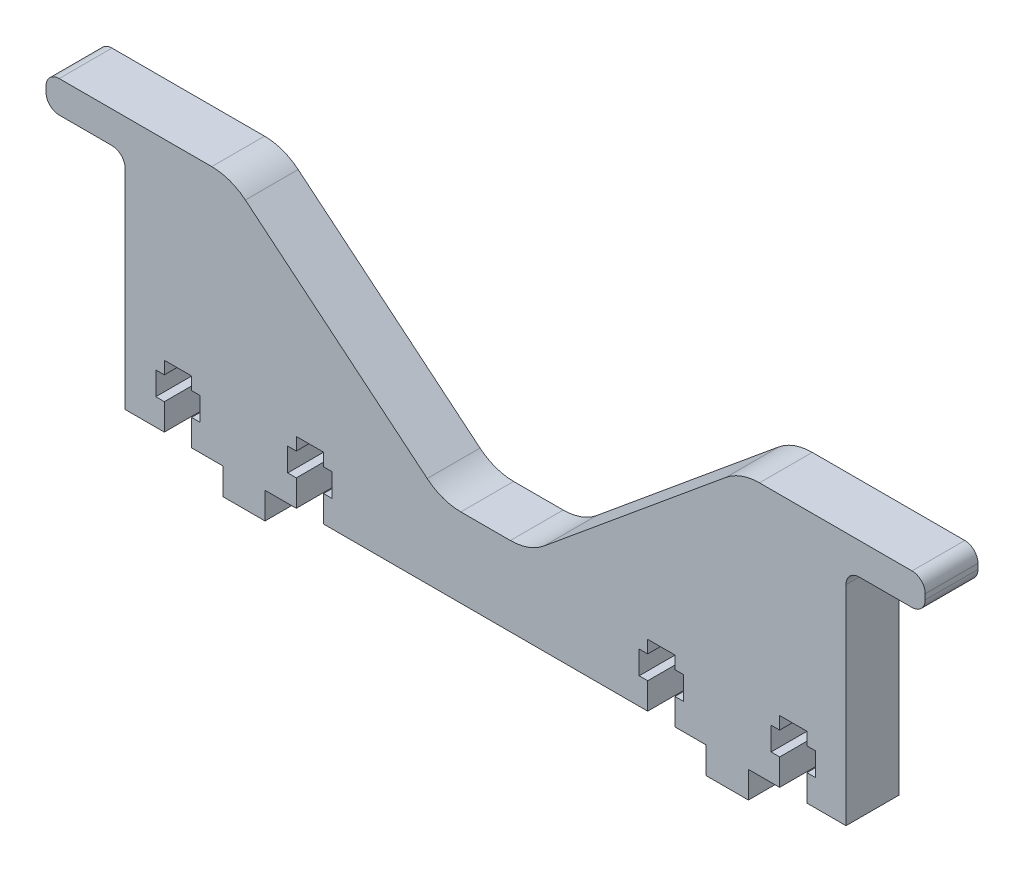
ISO-10303-21;
HEADER;
FILE_DESCRIPTION(('STEP AP214'),'2;1');
FILE_NAME('part.step','',(''),(''),'','','');
FILE_SCHEMA(('AUTOMOTIVE_DESIGN { 1 0 10303 214 1 1 1 1 }'));
ENDSEC;
DATA;
#1=APPLICATION_CONTEXT('core data for automotive mechanical design processes');
#2=APPLICATION_PROTOCOL_DEFINITION('international standard','automotive_design',2000,#1);
#3=PRODUCT_CONTEXT('',#1,'mechanical');
#4=PRODUCT('Part','Part','',(#3));
#5=PRODUCT_RELATED_PRODUCT_CATEGORY('part','',(#4));
#6=PRODUCT_DEFINITION_FORMATION('','',#4);
#7=PRODUCT_DEFINITION_CONTEXT('part definition',#1,'design');
#8=PRODUCT_DEFINITION('design','',#6,#7);
#9=PRODUCT_DEFINITION_SHAPE('','',#8);
#10=(LENGTH_UNIT() NAMED_UNIT(*) SI_UNIT(.MILLI.,.METRE.));
#11=(NAMED_UNIT(*) PLANE_ANGLE_UNIT() SI_UNIT($,.RADIAN.));
#12=(NAMED_UNIT(*) SI_UNIT($,.STERADIAN.) SOLID_ANGLE_UNIT());
#13=UNCERTAINTY_MEASURE_WITH_UNIT(LENGTH_MEASURE(1.E-05),#10,'distance_accuracy_value','');
#14=(GEOMETRIC_REPRESENTATION_CONTEXT(3) GLOBAL_UNCERTAINTY_ASSIGNED_CONTEXT((#13)) GLOBAL_UNIT_ASSIGNED_CONTEXT((#10,
#11,#12)) REPRESENTATION_CONTEXT('',''));
#15=CARTESIAN_POINT('',(0.,0.,0.));
#16=DIRECTION('',(0.,0.,1.));
#17=DIRECTION('',(1.,0.,0.));
#18=AXIS2_PLACEMENT_3D('',#15,#16,#17);
#19=CARTESIAN_POINT('',(86.7259999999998,0.,-12.7));
#20=DIRECTION('',(0.,-1.,0.));
#21=DIRECTION('',(0.,0.,-1.));
#22=AXIS2_PLACEMENT_3D('',#19,#20,#21);
#23=PLANE('',#22);
#24=DIRECTION('',(0.,0.,1.));
#25=VECTOR('',#24,1.);
#26=CARTESIAN_POINT('',(63.2309999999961,0.,-12.7));
#27=LINE('',#26,#25);
#28=CARTESIAN_POINT('',(63.2309999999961,0.,-12.7));
#29=VERTEX_POINT('',#28);
#30=CARTESIAN_POINT('',(63.2309999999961,0.,0.));
#31=VERTEX_POINT('',#30);
#32=EDGE_CURVE('E527',#29,#31,#27,.T.);
#33=ORIENTED_EDGE('',*,*,#32,.F.);
#34=DIRECTION('',(1.,0.,0.));
#35=VECTOR('',#34,1.);
#36=CARTESIAN_POINT('',(86.7259999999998,0.,-12.7));
#37=LINE('',#36,#35);
#38=CARTESIAN_POINT('',(70.7493999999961,0.,-12.7));
#39=VERTEX_POINT('',#38);
#40=EDGE_CURVE('E539',#29,#39,#37,.T.);
#41=ORIENTED_EDGE('',*,*,#40,.T.);
#42=DIRECTION('',(0.,0.,1.));
#43=VECTOR('',#42,1.);
#44=CARTESIAN_POINT('',(70.7493999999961,0.,-12.7));
#45=LINE('',#44,#43);
#46=CARTESIAN_POINT('',(70.7493999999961,0.,0.));
#47=VERTEX_POINT('',#46);
#48=EDGE_CURVE('E939',#39,#47,#45,.T.);
#49=ORIENTED_EDGE('',*,*,#48,.T.);
#50=DIRECTION('',(1.,0.,0.));
#51=VECTOR('',#50,1.);
#52=CARTESIAN_POINT('',(86.7259999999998,0.,0.));
#53=LINE('',#52,#51);
#54=EDGE_CURVE('E541',#31,#47,#53,.T.);
#55=ORIENTED_EDGE('',*,*,#54,.F.);
#56=EDGE_LOOP('',(#33,#41,#49,#55));
#57=FACE_BOUND('',#56,.T.);
#58=ADVANCED_FACE('F39',(#57),#23,.T.);
#59=DIRECTION('',(0.,0.,1.));
#60=VECTOR('',#59,1.);
#61=CARTESIAN_POINT('',(-53.0709999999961,0.,-12.7));
#62=LINE('',#61,#60);
#63=CARTESIAN_POINT('',(-53.0709999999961,0.,-12.7));
#64=VERTEX_POINT('',#63);
#65=CARTESIAN_POINT('',(-53.0709999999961,0.,0.));
#66=VERTEX_POINT('',#65);
#67=EDGE_CURVE('E601',#64,#66,#62,.T.);
#68=ORIENTED_EDGE('',*,*,#67,.F.);
#69=CARTESIAN_POINT('',(-45.5525999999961,0.,-12.7));
#70=VERTEX_POINT('',#69);
#71=EDGE_CURVE('E553',#64,#70,#37,.T.);
#72=ORIENTED_EDGE('',*,*,#71,.T.);
#73=DIRECTION('',(0.,0.,1.));
#74=VECTOR('',#73,1.);
#75=CARTESIAN_POINT('',(-45.5525999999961,0.,-12.7));
#76=LINE('',#75,#74);
#77=CARTESIAN_POINT('',(-45.5525999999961,0.,0.));
#78=VERTEX_POINT('',#77);
#79=EDGE_CURVE('E675',#70,#78,#76,.T.);
#80=ORIENTED_EDGE('',*,*,#79,.T.);
#81=EDGE_CURVE('E980',#66,#78,#53,.T.);
#82=ORIENTED_EDGE('',*,*,#81,.F.);
#83=EDGE_LOOP('',(#68,#72,#80,#82));
#84=FACE_BOUND('',#83,.T.);
#85=ADVANCED_FACE('F1072',(#84),#23,.T.);
#86=DIRECTION('',(0.,0.,1.));
#87=VECTOR('',#86,1.);
#88=CARTESIAN_POINT('',(-63.2309999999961,0.,-12.7));
#89=LINE('',#88,#87);
#90=CARTESIAN_POINT('',(-63.2309999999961,0.,-12.7));
#91=VERTEX_POINT('',#90);
#92=CARTESIAN_POINT('',(-63.2309999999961,0.,0.));
#93=VERTEX_POINT('',#92);
#94=EDGE_CURVE('E575',#91,#93,#89,.T.);
#95=ORIENTED_EDGE('',*,*,#94,.T.);
#96=CARTESIAN_POINT('',(-70.7493999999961,0.,0.));
#97=VERTEX_POINT('',#96);
#98=EDGE_CURVE('E978',#97,#93,#53,.T.);
#99=ORIENTED_EDGE('',*,*,#98,.F.);
#100=DIRECTION('',(0.,0.,1.));
#101=VECTOR('',#100,1.);
#102=CARTESIAN_POINT('',(-70.7493999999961,0.,-12.7));
#103=LINE('',#102,#101);
#104=CARTESIAN_POINT('',(-70.7493999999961,0.,-12.7));
#105=VERTEX_POINT('',#104);
#106=EDGE_CURVE('E577',#105,#97,#103,.T.);
#107=ORIENTED_EDGE('',*,*,#106,.F.);
#108=EDGE_CURVE('E557',#105,#91,#37,.T.);
#109=ORIENTED_EDGE('',*,*,#108,.T.);
#110=EDGE_LOOP('',(#95,#99,#107,#109));
#111=FACE_BOUND('',#110,.T.);
#112=ADVANCED_FACE('F573',(#111),#23,.T.);
#113=DIRECTION('',(0.,0.,1.));
#114=VECTOR('',#113,1.);
#115=CARTESIAN_POINT('',(-38.9993999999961,0.,-12.7));
#116=LINE('',#115,#114);
#117=CARTESIAN_POINT('',(-38.9993999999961,0.,-12.7));
#118=VERTEX_POINT('',#117);
#119=CARTESIAN_POINT('',(-38.9993999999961,0.,0.));
#120=VERTEX_POINT('',#119);
#121=EDGE_CURVE('E643',#118,#120,#116,.T.);
#122=ORIENTED_EDGE('',*,*,#121,.F.);
#123=CARTESIAN_POINT('',(38.9993999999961,0.,-12.7));
#124=VERTEX_POINT('',#123);
#125=EDGE_CURVE('E556',#118,#124,#37,.T.);
#126=ORIENTED_EDGE('',*,*,#125,.T.);
#127=DIRECTION('',(0.,0.,1.));
#128=VECTOR('',#127,1.);
#129=CARTESIAN_POINT('',(38.9993999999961,0.,-12.7));
#130=LINE('',#129,#128);
#131=CARTESIAN_POINT('',(38.9993999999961,0.,0.));
#132=VERTEX_POINT('',#131);
#133=EDGE_CURVE('E734',#124,#132,#130,.T.);
#134=ORIENTED_EDGE('',*,*,#133,.T.);
#135=EDGE_CURVE('E986',#120,#132,#53,.T.);
#136=ORIENTED_EDGE('',*,*,#135,.F.);
#137=EDGE_LOOP('',(#122,#126,#134,#136));
#138=FACE_BOUND('',#137,.T.);
#139=ADVANCED_FACE('F1002',(#138),#23,.T.);
#140=DIRECTION('',(0.,0.,1.));
#141=VECTOR('',#140,1.);
#142=CARTESIAN_POINT('',(-77.3025999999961,0.,-12.7));
#143=LINE('',#142,#141);
#144=CARTESIAN_POINT('',(-77.3025999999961,0.,-12.7));
#145=VERTEX_POINT('',#144);
#146=CARTESIAN_POINT('',(-77.3025999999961,0.,0.));
#147=VERTEX_POINT('',#146);
#148=EDGE_CURVE('E822',#145,#147,#143,.T.);
#149=ORIENTED_EDGE('',*,*,#148,.T.);
#150=CARTESIAN_POINT('',(-86.7259999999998,0.,0.));
#151=VERTEX_POINT('',#150);
#152=EDGE_CURVE('E977',#151,#147,#53,.T.);
#153=ORIENTED_EDGE('',*,*,#152,.F.);
#154=DIRECTION('',(0.,0.,1.));
#155=VECTOR('',#154,1.);
#156=CARTESIAN_POINT('',(-86.7259999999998,0.,-12.7));
#157=LINE('',#156,#155);
#158=CARTESIAN_POINT('',(-86.7259999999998,0.,-12.7));
#159=VERTEX_POINT('',#158);
#160=EDGE_CURVE('E1108',#159,#151,#157,.T.);
#161=ORIENTED_EDGE('',*,*,#160,.F.);
#162=EDGE_CURVE('E554',#159,#145,#37,.T.);
#163=ORIENTED_EDGE('',*,*,#162,.T.);
#164=EDGE_LOOP('',(#149,#153,#161,#163));
#165=FACE_BOUND('',#164,.T.);
#166=ADVANCED_FACE('F1089',(#165),#23,.T.);
#167=DIRECTION('',(0.,0.,1.));
#168=VECTOR('',#167,1.);
#169=CARTESIAN_POINT('',(53.0709999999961,0.,-12.7));
#170=LINE('',#169,#168);
#171=CARTESIAN_POINT('',(53.0709999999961,0.,-12.7));
#172=VERTEX_POINT('',#171);
#173=CARTESIAN_POINT('',(53.0709999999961,0.,0.));
#174=VERTEX_POINT('',#173);
#175=EDGE_CURVE('E542',#172,#174,#170,.T.);
#176=ORIENTED_EDGE('',*,*,#175,.T.);
#177=CARTESIAN_POINT('',(45.5525999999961,0.,0.));
#178=VERTEX_POINT('',#177);
#179=EDGE_CURVE('E979',#178,#174,#53,.T.);
#180=ORIENTED_EDGE('',*,*,#179,.F.);
#181=DIRECTION('',(0.,0.,1.));
#182=VECTOR('',#181,1.);
#183=CARTESIAN_POINT('',(45.5525999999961,0.,-12.7));
#184=LINE('',#183,#182);
#185=CARTESIAN_POINT('',(45.5525999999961,0.,-12.7));
#186=VERTEX_POINT('',#185);
#187=EDGE_CURVE('E787',#186,#178,#184,.T.);
#188=ORIENTED_EDGE('',*,*,#187,.F.);
#189=EDGE_CURVE('E550',#186,#172,#37,.T.);
#190=ORIENTED_EDGE('',*,*,#189,.T.);
#191=EDGE_LOOP('',(#176,#180,#188,#190));
#192=FACE_BOUND('',#191,.T.);
#193=ADVANCED_FACE('F1044',(#192),#23,.T.);
#194=DIRECTION('',(0.,0.,1.));
#195=VECTOR('',#194,1.);
#196=CARTESIAN_POINT('',(77.3025999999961,0.,-12.7));
#197=LINE('',#196,#195);
#198=CARTESIAN_POINT('',(77.3025999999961,0.,-12.7));
#199=VERTEX_POINT('',#198);
#200=CARTESIAN_POINT('',(77.3025999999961,0.,0.));
#201=VERTEX_POINT('',#200);
#202=EDGE_CURVE('E907',#199,#201,#197,.T.);
#203=ORIENTED_EDGE('',*,*,#202,.F.);
#204=CARTESIAN_POINT('',(86.7259999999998,0.,-12.7));
#205=VERTEX_POINT('',#204);
#206=EDGE_CURVE('E551',#199,#205,#37,.T.);
#207=ORIENTED_EDGE('',*,*,#206,.T.);
#208=DIRECTION('',(0.,0.,1.));
#209=VECTOR('',#208,1.);
#210=CARTESIAN_POINT('',(86.7259999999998,0.,-12.7));
#211=LINE('',#210,#209);
#212=CARTESIAN_POINT('',(86.7259999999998,0.,0.));
#213=VERTEX_POINT('',#212);
#214=EDGE_CURVE('E974',#205,#213,#211,.T.);
#215=ORIENTED_EDGE('',*,*,#214,.T.);
#216=EDGE_CURVE('E941',#201,#213,#53,.T.);
#217=ORIENTED_EDGE('',*,*,#216,.F.);
#218=EDGE_LOOP('',(#203,#207,#215,#217));
#219=FACE_BOUND('',#218,.T.);
#220=ADVANCED_FACE('F972',(#219),#23,.T.);
#221=CARTESIAN_POINT('',(-86.7259999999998,0.,-12.7));
#222=DIRECTION('',(-1.,0.,0.));
#223=DIRECTION('',(0.,-1.,0.));
#224=AXIS2_PLACEMENT_3D('',#221,#222,#223);
#225=PLANE('',#224);
#226=ORIENTED_EDGE('',*,*,#160,.T.);
#227=DIRECTION('',(0.,-1.,0.));
#228=VECTOR('',#227,1.);
#229=CARTESIAN_POINT('',(-86.7259999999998,0.,0.));
#230=LINE('',#229,#228);
#231=CARTESIAN_POINT('',(-86.7259999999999,50.2395117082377,0.));
#232=VERTEX_POINT('',#231);
#233=EDGE_CURVE('E558',#232,#151,#230,.T.);
#234=ORIENTED_EDGE('',*,*,#233,.F.);
#235=DIRECTION('',(0.,0.,1.));
#236=VECTOR('',#235,1.);
#237=CARTESIAN_POINT('',(-86.7259999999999,50.2395117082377,-12.7));
#238=LINE('',#237,#236);
#239=CARTESIAN_POINT('',(-86.7259999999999,50.2395117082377,-12.7));
#240=VERTEX_POINT('',#239);
#241=EDGE_CURVE('E1157',#232,#240,#238,.F.);
#242=ORIENTED_EDGE('',*,*,#241,.T.);
#243=DIRECTION('',(0.,-1.,0.));
#244=VECTOR('',#243,1.);
#245=CARTESIAN_POINT('',(-86.7259999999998,0.,-12.7));
#246=LINE('',#245,#244);
#247=EDGE_CURVE('E1110',#240,#159,#246,.T.);
#248=ORIENTED_EDGE('',*,*,#247,.T.);
#249=EDGE_LOOP('',(#226,#234,#242,#248));
#250=FACE_BOUND('',#249,.T.);
#251=ADVANCED_FACE('F1081',(#250),#225,.T.);
#252=CARTESIAN_POINT('',(-86.7259999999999,53.4145117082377,-12.7));
#253=DIRECTION('',(0.,-1.,0.));
#254=DIRECTION('',(1.,0.,0.));
#255=AXIS2_PLACEMENT_3D('',#252,#253,#254);
#256=PLANE('',#255);
#257=DIRECTION('',(1.,0.,0.));
#258=VECTOR('',#257,1.);
#259=CARTESIAN_POINT('',(-86.7259999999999,53.4145117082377,-12.7));
#260=LINE('',#259,#258);
#261=CARTESIAN_POINT('',(-102.601,53.4145117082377,-12.7));
#262=VERTEX_POINT('',#261);
#263=CARTESIAN_POINT('',(-89.9009999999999,53.4145117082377,-12.7));
#264=VERTEX_POINT('',#263);
#265=EDGE_CURVE('E1241',#262,#264,#260,.T.);
#266=ORIENTED_EDGE('',*,*,#265,.T.);
#267=DIRECTION('',(0.,0.,1.));
#268=VECTOR('',#267,1.);
#269=CARTESIAN_POINT('',(-89.9009999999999,53.4145117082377,0.));
#270=LINE('',#269,#268);
#271=CARTESIAN_POINT('',(-89.9009999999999,53.4145117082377,0.));
#272=VERTEX_POINT('',#271);
#273=EDGE_CURVE('E1154',#264,#272,#270,.T.);
#274=ORIENTED_EDGE('',*,*,#273,.T.);
#275=DIRECTION('',(1.,0.,0.));
#276=VECTOR('',#275,1.);
#277=CARTESIAN_POINT('',(-86.7259999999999,53.4145117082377,0.));
#278=LINE('',#277,#276);
#279=CARTESIAN_POINT('',(-102.601,53.4145117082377,0.));
#280=VERTEX_POINT('',#279);
#281=EDGE_CURVE('E1106',#280,#272,#278,.T.);
#282=ORIENTED_EDGE('',*,*,#281,.F.);
#283=DIRECTION('',(0.,0.,1.));
#284=VECTOR('',#283,1.);
#285=CARTESIAN_POINT('',(-102.601,53.4145117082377,-12.7));
#286=LINE('',#285,#284);
#287=EDGE_CURVE('E1152',#280,#262,#286,.F.);
#288=ORIENTED_EDGE('',*,*,#287,.T.);
#289=EDGE_LOOP('',(#266,#274,#282,#288));
#290=FACE_BOUND('',#289,.T.);
#291=ADVANCED_FACE('F1086',(#290),#256,.T.);
#292=CARTESIAN_POINT('',(-105.776,53.4145117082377,-12.7));
#293=DIRECTION('',(-1.,0.,0.));
#294=DIRECTION('',(0.,0.,1.));
#295=AXIS2_PLACEMENT_3D('',#292,#293,#294);
#296=PLANE('',#295);
#297=DIRECTION('',(0.,-1.,0.));
#298=VECTOR('',#297,1.);
#299=CARTESIAN_POINT('',(-105.776,53.4145117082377,-12.7));
#300=LINE('',#299,#298);
#301=CARTESIAN_POINT('',(-105.776,57.8595117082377,-12.7));
#302=VERTEX_POINT('',#301);
#303=CARTESIAN_POINT('',(-105.776,56.5895117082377,-12.7));
#304=VERTEX_POINT('',#303);
#305=EDGE_CURVE('E1238',#302,#304,#300,.T.);
#306=ORIENTED_EDGE('',*,*,#305,.T.);
#307=DIRECTION('',(0.,0.,1.));
#308=VECTOR('',#307,1.);
#309=CARTESIAN_POINT('',(-105.776,56.5895117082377,-12.7));
#310=LINE('',#309,#308);
#311=CARTESIAN_POINT('',(-105.776,56.5895117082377,0.));
#312=VERTEX_POINT('',#311);
#313=EDGE_CURVE('E1161',#304,#312,#310,.T.);
#314=ORIENTED_EDGE('',*,*,#313,.T.);
#315=DIRECTION('',(0.,-1.,0.));
#316=VECTOR('',#315,1.);
#317=CARTESIAN_POINT('',(-105.776,53.4145117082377,0.));
#318=LINE('',#317,#316);
#319=CARTESIAN_POINT('',(-105.776,57.8595117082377,0.));
#320=VERTEX_POINT('',#319);
#321=EDGE_CURVE('E1402',#320,#312,#318,.T.);
#322=ORIENTED_EDGE('',*,*,#321,.F.);
#323=DIRECTION('',(0.,0.,1.));
#324=VECTOR('',#323,1.);
#325=CARTESIAN_POINT('',(-105.776,57.8595117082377,-12.7));
#326=LINE('',#325,#324);
#327=EDGE_CURVE('E1159',#320,#302,#326,.F.);
#328=ORIENTED_EDGE('',*,*,#327,.T.);
#329=EDGE_LOOP('',(#306,#314,#322,#328));
#330=FACE_BOUND('',#329,.T.);
#331=ADVANCED_FACE('F1352',(#330),#296,.T.);
#332=CARTESIAN_POINT('',(-105.776,61.0345117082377,-12.7));
#333=DIRECTION('',(0.,1.,0.));
#334=DIRECTION('',(-1.,0.,0.));
#335=AXIS2_PLACEMENT_3D('',#332,#333,#334);
#336=PLANE('',#335);
#337=DIRECTION('',(-1.,0.,0.));
#338=VECTOR('',#337,1.);
#339=CARTESIAN_POINT('',(-105.776,61.0345117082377,-12.7));
#340=LINE('',#339,#338);
#341=CARTESIAN_POINT('',(-65.8948513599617,61.0345117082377,-12.7));
#342=VERTEX_POINT('',#341);
#343=CARTESIAN_POINT('',(-102.601,61.0345117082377,-12.7));
#344=VERTEX_POINT('',#343);
#345=EDGE_CURVE('E1235',#342,#344,#340,.T.);
#346=ORIENTED_EDGE('',*,*,#345,.T.);
#347=DIRECTION('',(0.,0.,1.));
#348=VECTOR('',#347,1.);
#349=CARTESIAN_POINT('',(-102.601,61.0345117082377,-12.7));
#350=LINE('',#349,#348);
#351=CARTESIAN_POINT('',(-102.601,61.0345117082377,0.));
#352=VERTEX_POINT('',#351);
#353=EDGE_CURVE('E1180',#344,#352,#350,.T.);
#354=ORIENTED_EDGE('',*,*,#353,.T.);
#355=DIRECTION('',(-1.,0.,0.));
#356=VECTOR('',#355,1.);
#357=CARTESIAN_POINT('',(-105.776,61.0345117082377,0.));
#358=LINE('',#357,#356);
#359=CARTESIAN_POINT('',(-65.8948513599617,61.0345117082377,0.));
#360=VERTEX_POINT('',#359);
#361=EDGE_CURVE('E1399',#360,#352,#358,.T.);
#362=ORIENTED_EDGE('',*,*,#361,.F.);
#363=DIRECTION('',(0.,0.,1.));
#364=VECTOR('',#363,1.);
#365=CARTESIAN_POINT('',(-65.8948513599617,61.0345117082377,-12.7));
#366=LINE('',#365,#364);
#367=EDGE_CURVE('E1124',#360,#342,#366,.F.);
#368=ORIENTED_EDGE('',*,*,#367,.T.);
#369=EDGE_LOOP('',(#346,#354,#362,#368));
#370=FACE_BOUND('',#369,.T.);
#371=ADVANCED_FACE('F1355',(#370),#336,.T.);
#372=CARTESIAN_POINT('',(-61.3259999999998,61.0345117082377,-12.7));
#373=DIRECTION('',(0.637055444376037,0.770817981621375,0.));
#374=DIRECTION('',(-0.770817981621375,0.637055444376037,0.));
#375=AXIS2_PLACEMENT_3D('',#372,#373,#374);
#376=PLANE('',#375);
#377=DIRECTION('',(-0.770817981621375,0.637055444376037,0.));
#378=VECTOR('',#377,1.);
#379=CARTESIAN_POINT('',(-61.3259999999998,61.0345117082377,-12.7));
#380=LINE('',#379,#378);
#381=CARTESIAN_POINT('',(-14.0477527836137,21.9606116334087,-12.7));
#382=VERTEX_POINT('',#381);
#383=CARTESIAN_POINT('',(-57.804247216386,58.1239000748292,-12.7));
#384=VERTEX_POINT('',#383);
#385=EDGE_CURVE('E1232',#382,#384,#380,.T.);
#386=ORIENTED_EDGE('',*,*,#385,.T.);
#387=DIRECTION('',(0.,0.,1.));
#388=VECTOR('',#387,1.);
#389=CARTESIAN_POINT('',(-57.804247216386,58.1239000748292,-12.7));
#390=LINE('',#389,#388);
#391=CARTESIAN_POINT('',(-57.804247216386,58.1239000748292,0.));
#392=VERTEX_POINT('',#391);
#393=EDGE_CURVE('E1113',#384,#392,#390,.T.);
#394=ORIENTED_EDGE('',*,*,#393,.T.);
#395=DIRECTION('',(-0.770817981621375,0.637055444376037,0.));
#396=VECTOR('',#395,1.);
#397=CARTESIAN_POINT('',(-61.3259999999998,61.0345117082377,0.));
#398=LINE('',#397,#396);
#399=CARTESIAN_POINT('',(-14.0477527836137,21.9606116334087,0.));
#400=VERTEX_POINT('',#399);
#401=EDGE_CURVE('E1396',#400,#392,#398,.T.);
#402=ORIENTED_EDGE('',*,*,#401,.F.);
#403=DIRECTION('',(0.,0.,1.));
#404=VECTOR('',#403,1.);
#405=CARTESIAN_POINT('',(-14.0477527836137,21.9606116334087,-12.7));
#406=LINE('',#405,#404);
#407=EDGE_CURVE('E1111',#400,#382,#406,.F.);
#408=ORIENTED_EDGE('',*,*,#407,.T.);
#409=EDGE_LOOP('',(#386,#394,#402,#408));
#410=FACE_BOUND('',#409,.T.);
#411=ADVANCED_FACE('F1359',(#410),#376,.T.);
#412=CARTESIAN_POINT('',(10.5259999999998,19.0500000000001,-12.7));
#413=DIRECTION('',(0.,1.,0.));
#414=DIRECTION('',(0.,0.,1.));
#415=AXIS2_PLACEMENT_3D('',#412,#413,#414);
#416=PLANE('',#415);
#417=DIRECTION('',(-1.,0.,0.));
#418=VECTOR('',#417,1.);
#419=CARTESIAN_POINT('',(10.5259999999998,19.0500000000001,-12.7));
#420=LINE('',#419,#418);
#421=CARTESIAN_POINT('',(5.95714864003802,19.0500000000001,-12.7));
#422=VERTEX_POINT('',#421);
#423=CARTESIAN_POINT('',(-5.95714864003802,19.0500000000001,-12.7));
#424=VERTEX_POINT('',#423);
#425=EDGE_CURVE('E1229',#422,#424,#420,.T.);
#426=ORIENTED_EDGE('',*,*,#425,.T.);
#427=DIRECTION('',(0.,0.,1.));
#428=VECTOR('',#427,1.);
#429=CARTESIAN_POINT('',(-5.95714864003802,19.0500000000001,0.));
#430=LINE('',#429,#428);
#431=CARTESIAN_POINT('',(-5.95714864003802,19.0500000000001,0.));
#432=VERTEX_POINT('',#431);
#433=EDGE_CURVE('E1133',#424,#432,#430,.T.);
#434=ORIENTED_EDGE('',*,*,#433,.T.);
#435=DIRECTION('',(-1.,0.,0.));
#436=VECTOR('',#435,1.);
#437=CARTESIAN_POINT('',(10.5259999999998,19.0500000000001,0.));
#438=LINE('',#437,#436);
#439=CARTESIAN_POINT('',(5.95714864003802,19.0500000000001,0.));
#440=VERTEX_POINT('',#439);
#441=EDGE_CURVE('E1393',#440,#432,#438,.T.);
#442=ORIENTED_EDGE('',*,*,#441,.F.);
#443=DIRECTION('',(0.,0.,1.));
#444=VECTOR('',#443,1.);
#445=CARTESIAN_POINT('',(5.95714864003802,19.0500000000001,-12.7));
#446=LINE('',#445,#444);
#447=EDGE_CURVE('E1131',#440,#422,#446,.F.);
#448=ORIENTED_EDGE('',*,*,#447,.T.);
#449=EDGE_LOOP('',(#426,#434,#442,#448));
#450=FACE_BOUND('',#449,.T.);
#451=ADVANCED_FACE('F1363',(#450),#416,.T.);
#452=CARTESIAN_POINT('',(61.3259999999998,61.0345117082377,-12.7));
#453=DIRECTION('',(-0.637055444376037,0.770817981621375,0.));
#454=DIRECTION('',(-0.770817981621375,-0.637055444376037,0.));
#455=AXIS2_PLACEMENT_3D('',#452,#453,#454);
#456=PLANE('',#455);
#457=DIRECTION('',(-0.770817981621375,-0.637055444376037,0.));
#458=VECTOR('',#457,1.);
#459=CARTESIAN_POINT('',(61.3259999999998,61.0345117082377,-12.7));
#460=LINE('',#459,#458);
#461=CARTESIAN_POINT('',(57.804247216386,58.1239000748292,-12.7));
#462=VERTEX_POINT('',#461);
#463=CARTESIAN_POINT('',(14.0477527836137,21.9606116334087,-12.7));
#464=VERTEX_POINT('',#463);
#465=EDGE_CURVE('E1226',#462,#464,#460,.T.);
#466=ORIENTED_EDGE('',*,*,#465,.T.);
#467=DIRECTION('',(0.,0.,1.));
#468=VECTOR('',#467,1.);
#469=CARTESIAN_POINT('',(14.0477527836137,21.9606116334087,0.));
#470=LINE('',#469,#468);
#471=CARTESIAN_POINT('',(14.0477527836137,21.9606116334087,0.));
#472=VERTEX_POINT('',#471);
#473=EDGE_CURVE('E1138',#464,#472,#470,.T.);
#474=ORIENTED_EDGE('',*,*,#473,.T.);
#475=DIRECTION('',(-0.770817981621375,-0.637055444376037,0.));
#476=VECTOR('',#475,1.);
#477=CARTESIAN_POINT('',(61.3259999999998,61.0345117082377,0.));
#478=LINE('',#477,#476);
#479=CARTESIAN_POINT('',(57.804247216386,58.1239000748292,0.));
#480=VERTEX_POINT('',#479);
#481=EDGE_CURVE('E1390',#480,#472,#478,.T.);
#482=ORIENTED_EDGE('',*,*,#481,.F.);
#483=DIRECTION('',(0.,0.,1.));
#484=VECTOR('',#483,1.);
#485=CARTESIAN_POINT('',(57.804247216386,58.1239000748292,-12.7));
#486=LINE('',#485,#484);
#487=EDGE_CURVE('E1136',#480,#462,#486,.F.);
#488=ORIENTED_EDGE('',*,*,#487,.T.);
#489=EDGE_LOOP('',(#466,#474,#482,#488));
#490=FACE_BOUND('',#489,.T.);
#491=ADVANCED_FACE('F1367',(#490),#456,.T.);
#492=CARTESIAN_POINT('',(105.776,61.0345117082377,-12.7));
#493=DIRECTION('',(0.,1.,0.));
#494=DIRECTION('',(-1.,0.,0.));
#495=AXIS2_PLACEMENT_3D('',#492,#493,#494);
#496=PLANE('',#495);
#497=DIRECTION('',(-1.,0.,0.));
#498=VECTOR('',#497,1.);
#499=CARTESIAN_POINT('',(105.776,61.0345117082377,0.));
#500=LINE('',#499,#498);
#501=CARTESIAN_POINT('',(102.601,61.0345117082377,0.));
#502=VERTEX_POINT('',#501);
#503=CARTESIAN_POINT('',(65.8948513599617,61.0345117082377,0.));
#504=VERTEX_POINT('',#503);
#505=EDGE_CURVE('E1388',#502,#504,#500,.T.);
#506=ORIENTED_EDGE('',*,*,#505,.F.);
#507=DIRECTION('',(0.,0.,1.));
#508=VECTOR('',#507,1.);
#509=CARTESIAN_POINT('',(102.601,61.0345117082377,-12.7));
#510=LINE('',#509,#508);
#511=CARTESIAN_POINT('',(102.601,61.0345117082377,-12.7));
#512=VERTEX_POINT('',#511);
#513=EDGE_CURVE('E1196',#502,#512,#510,.F.);
#514=ORIENTED_EDGE('',*,*,#513,.T.);
#515=DIRECTION('',(-1.,0.,0.));
#516=VECTOR('',#515,1.);
#517=CARTESIAN_POINT('',(105.776,61.0345117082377,-12.7));
#518=LINE('',#517,#516);
#519=CARTESIAN_POINT('',(65.8948513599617,61.0345117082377,-12.7));
#520=VERTEX_POINT('',#519);
#521=EDGE_CURVE('E1222',#512,#520,#518,.T.);
#522=ORIENTED_EDGE('',*,*,#521,.T.);
#523=DIRECTION('',(0.,0.,1.));
#524=VECTOR('',#523,1.);
#525=CARTESIAN_POINT('',(65.8948513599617,61.0345117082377,-12.7));
#526=LINE('',#525,#524);
#527=EDGE_CURVE('E1141',#520,#504,#526,.T.);
#528=ORIENTED_EDGE('',*,*,#527,.T.);
#529=EDGE_LOOP('',(#506,#514,#522,#528));
#530=FACE_BOUND('',#529,.T.);
#531=ADVANCED_FACE('F1371',(#530),#496,.T.);
#532=CARTESIAN_POINT('',(105.776,53.4145117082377,-12.7));
#533=DIRECTION('',(1.,0.,0.));
#534=DIRECTION('',(0.,0.,-1.));
#535=AXIS2_PLACEMENT_3D('',#532,#533,#534);
#536=PLANE('',#535);
#537=DIRECTION('',(0.,1.,0.));
#538=VECTOR('',#537,1.);
#539=CARTESIAN_POINT('',(105.776,53.4145117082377,0.));
#540=LINE('',#539,#538);
#541=CARTESIAN_POINT('',(105.776,56.5895117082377,0.));
#542=VERTEX_POINT('',#541);
#543=CARTESIAN_POINT('',(105.776,57.8595117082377,0.));
#544=VERTEX_POINT('',#543);
#545=EDGE_CURVE('E1212',#542,#544,#540,.T.);
#546=ORIENTED_EDGE('',*,*,#545,.F.);
#547=DIRECTION('',(0.,0.,1.));
#548=VECTOR('',#547,1.);
#549=CARTESIAN_POINT('',(105.776,56.5895117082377,-12.7));
#550=LINE('',#549,#548);
#551=CARTESIAN_POINT('',(105.776,56.5895117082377,-12.7));
#552=VERTEX_POINT('',#551);
#553=EDGE_CURVE('E1194',#542,#552,#550,.F.);
#554=ORIENTED_EDGE('',*,*,#553,.T.);
#555=DIRECTION('',(0.,1.,0.));
#556=VECTOR('',#555,1.);
#557=CARTESIAN_POINT('',(105.776,53.4145117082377,-12.7));
#558=LINE('',#557,#556);
#559=CARTESIAN_POINT('',(105.776,57.8595117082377,-12.7));
#560=VERTEX_POINT('',#559);
#561=EDGE_CURVE('E1219',#552,#560,#558,.T.);
#562=ORIENTED_EDGE('',*,*,#561,.T.);
#563=DIRECTION('',(0.,0.,1.));
#564=VECTOR('',#563,1.);
#565=CARTESIAN_POINT('',(105.776,57.8595117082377,-12.7));
#566=LINE('',#565,#564);
#567=EDGE_CURVE('E1191',#560,#544,#566,.T.);
#568=ORIENTED_EDGE('',*,*,#567,.T.);
#569=EDGE_LOOP('',(#546,#554,#562,#568));
#570=FACE_BOUND('',#569,.T.);
#571=ADVANCED_FACE('F1375',(#570),#536,.T.);
#572=CARTESIAN_POINT('',(86.7259999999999,53.4145117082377,-12.7));
#573=DIRECTION('',(0.,-1.,0.));
#574=DIRECTION('',(1.,0.,0.));
#575=AXIS2_PLACEMENT_3D('',#572,#573,#574);
#576=PLANE('',#575);
#577=DIRECTION('',(1.,0.,0.));
#578=VECTOR('',#577,1.);
#579=CARTESIAN_POINT('',(86.7259999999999,53.4145117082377,0.));
#580=LINE('',#579,#578);
#581=CARTESIAN_POINT('',(89.9009999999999,53.4145117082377,0.));
#582=VERTEX_POINT('',#581);
#583=CARTESIAN_POINT('',(102.601,53.4145117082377,0.));
#584=VERTEX_POINT('',#583);
#585=EDGE_CURVE('E1203',#582,#584,#580,.T.);
#586=ORIENTED_EDGE('',*,*,#585,.F.);
#587=DIRECTION('',(0.,0.,1.));
#588=VECTOR('',#587,1.);
#589=CARTESIAN_POINT('',(89.9009999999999,53.4145117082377,-12.7));
#590=LINE('',#589,#588);
#591=CARTESIAN_POINT('',(89.9009999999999,53.4145117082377,-12.7));
#592=VERTEX_POINT('',#591);
#593=EDGE_CURVE('E1189',#582,#592,#590,.F.);
#594=ORIENTED_EDGE('',*,*,#593,.T.);
#595=DIRECTION('',(1.,0.,0.));
#596=VECTOR('',#595,1.);
#597=CARTESIAN_POINT('',(86.7259999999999,53.4145117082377,-12.7));
#598=LINE('',#597,#596);
#599=CARTESIAN_POINT('',(102.601,53.4145117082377,-12.7));
#600=VERTEX_POINT('',#599);
#601=EDGE_CURVE('E567',#592,#600,#598,.T.);
#602=ORIENTED_EDGE('',*,*,#601,.T.);
#603=DIRECTION('',(0.,0.,1.));
#604=VECTOR('',#603,1.);
#605=CARTESIAN_POINT('',(102.601,53.4145117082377,-12.7));
#606=LINE('',#605,#604);
#607=EDGE_CURVE('E1186',#600,#584,#606,.T.);
#608=ORIENTED_EDGE('',*,*,#607,.T.);
#609=EDGE_LOOP('',(#586,#594,#602,#608));
#610=FACE_BOUND('',#609,.T.);
#611=ADVANCED_FACE('F1208',(#610),#576,.T.);
#612=CARTESIAN_POINT('',(86.7259999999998,0.,-12.7));
#613=DIRECTION('',(1.,0.,0.));
#614=DIRECTION('',(0.,1.,0.));
#615=AXIS2_PLACEMENT_3D('',#612,#613,#614);
#616=PLANE('',#615);
#617=DIRECTION('',(0.,0.,1.));
#618=VECTOR('',#617,1.);
#619=CARTESIAN_POINT('',(86.7259999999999,50.2395117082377,0.));
#620=LINE('',#619,#618);
#621=CARTESIAN_POINT('',(86.7259999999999,50.2395117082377,-12.7));
#622=VERTEX_POINT('',#621);
#623=CARTESIAN_POINT('',(86.7259999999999,50.2395117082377,0.));
#624=VERTEX_POINT('',#623);
#625=EDGE_CURVE('E1183',#622,#624,#620,.T.);
#626=ORIENTED_EDGE('',*,*,#625,.T.);
#627=DIRECTION('',(0.,1.,0.));
#628=VECTOR('',#627,1.);
#629=CARTESIAN_POINT('',(86.7259999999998,0.,0.));
#630=LINE('',#629,#628);
#631=EDGE_CURVE('E984',#213,#624,#630,.T.);
#632=ORIENTED_EDGE('',*,*,#631,.F.);
#633=ORIENTED_EDGE('',*,*,#214,.F.);
#634=DIRECTION('',(0.,1.,0.));
#635=VECTOR('',#634,1.);
#636=CARTESIAN_POINT('',(86.7259999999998,0.,-12.7));
#637=LINE('',#636,#635);
#638=EDGE_CURVE('E562',#205,#622,#637,.T.);
#639=ORIENTED_EDGE('',*,*,#638,.T.);
#640=EDGE_LOOP('',(#626,#632,#633,#639));
#641=FACE_BOUND('',#640,.T.);
#642=ADVANCED_FACE('F1346',(#641),#616,.T.);
#643=CARTESIAN_POINT('',(0.,0.,-12.7));
#644=DIRECTION('',(0.,0.,-1.));
#645=DIRECTION('',(-1.,0.,0.));
#646=AXIS2_PLACEMENT_3D('',#643,#644,#645);
#647=PLANE('',#646);
#648=CARTESIAN_POINT('',(89.9009999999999,50.2395117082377,-12.7));
#649=DIRECTION('',(0.,0.,-1.));
#650=DIRECTION('',(-1.,0.,0.));
#651=AXIS2_PLACEMENT_3D('',#648,#649,#650);
#652=CIRCLE('',#651,3.175);
#653=EDGE_CURVE('E11',#592,#622,#652,.F.);
#654=ORIENTED_EDGE('',*,*,#653,.T.);
#655=ORIENTED_EDGE('',*,*,#638,.F.);
#656=ORIENTED_EDGE('',*,*,#206,.F.);
#657=DIRECTION('',(0.,1.,0.));
#658=VECTOR('',#657,1.);
#659=CARTESIAN_POINT('',(77.3025999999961,0.,-12.7));
#660=LINE('',#659,#658);
#661=CARTESIAN_POINT('',(77.3025999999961,6.35,-12.7));
#662=VERTEX_POINT('',#661);
#663=EDGE_CURVE('E876',#199,#662,#660,.T.);
#664=ORIENTED_EDGE('',*,*,#663,.T.);
#665=DIRECTION('',(1.,0.,0.));
#666=VECTOR('',#665,1.);
#667=CARTESIAN_POINT('',(77.3025999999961,6.35,-12.7));
#668=LINE('',#667,#666);
#669=CARTESIAN_POINT('',(79.3599999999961,6.35,-12.7));
#670=VERTEX_POINT('',#669);
#671=EDGE_CURVE('E879',#662,#670,#668,.T.);
#672=ORIENTED_EDGE('',*,*,#671,.T.);
#673=DIRECTION('',(0.,1.,0.));
#674=VECTOR('',#673,1.);
#675=CARTESIAN_POINT('',(79.3599999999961,6.35,-12.7));
#676=LINE('',#675,#674);
#677=CARTESIAN_POINT('',(79.3599999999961,11.938,-12.7));
#678=VERTEX_POINT('',#677);
#679=EDGE_CURVE('E883',#670,#678,#676,.T.);
#680=ORIENTED_EDGE('',*,*,#679,.T.);
#681=DIRECTION('',(-1.,0.,0.));
#682=VECTOR('',#681,1.);
#683=CARTESIAN_POINT('',(79.3599999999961,11.938,-12.7));
#684=LINE('',#683,#682);
#685=CARTESIAN_POINT('',(77.3025999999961,11.938,-12.7));
#686=VERTEX_POINT('',#685);
#687=EDGE_CURVE('E886',#678,#686,#684,.T.);
#688=ORIENTED_EDGE('',*,*,#687,.T.);
#689=DIRECTION('',(0.,1.,0.));
#690=VECTOR('',#689,1.);
#691=CARTESIAN_POINT('',(77.3025999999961,11.938,-12.7));
#692=LINE('',#691,#690);
#693=CARTESIAN_POINT('',(77.3025999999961,14.986,-12.7));
#694=VERTEX_POINT('',#693);
#695=EDGE_CURVE('E889',#686,#694,#692,.T.);
#696=ORIENTED_EDGE('',*,*,#695,.T.);
#697=DIRECTION('',(-1.,0.,0.));
#698=VECTOR('',#697,1.);
#699=CARTESIAN_POINT('',(77.3025999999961,14.986,-12.7));
#700=LINE('',#699,#698);
#701=CARTESIAN_POINT('',(70.7493999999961,14.986,-12.7));
#702=VERTEX_POINT('',#701);
#703=EDGE_CURVE('E892',#694,#702,#700,.T.);
#704=ORIENTED_EDGE('',*,*,#703,.T.);
#705=DIRECTION('',(0.,-1.,0.));
#706=VECTOR('',#705,1.);
#707=CARTESIAN_POINT('',(70.7493999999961,11.938,-12.7));
#708=LINE('',#707,#706);
#709=CARTESIAN_POINT('',(70.7493999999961,11.938,-12.7));
#710=VERTEX_POINT('',#709);
#711=EDGE_CURVE('E895',#702,#710,#708,.T.);
#712=ORIENTED_EDGE('',*,*,#711,.T.);
#713=DIRECTION('',(-1.,0.,0.));
#714=VECTOR('',#713,1.);
#715=CARTESIAN_POINT('',(68.6919999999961,11.938,-12.7));
#716=LINE('',#715,#714);
#717=CARTESIAN_POINT('',(68.6919999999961,11.938,-12.7));
#718=VERTEX_POINT('',#717);
#719=EDGE_CURVE('E898',#710,#718,#716,.T.);
#720=ORIENTED_EDGE('',*,*,#719,.T.);
#721=DIRECTION('',(0.,-1.,0.));
#722=VECTOR('',#721,1.);
#723=CARTESIAN_POINT('',(68.6919999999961,6.35,-12.7));
#724=LINE('',#723,#722);
#725=CARTESIAN_POINT('',(68.6919999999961,6.35,-12.7));
#726=VERTEX_POINT('',#725);
#727=EDGE_CURVE('E901',#718,#726,#724,.T.);
#728=ORIENTED_EDGE('',*,*,#727,.T.);
#729=DIRECTION('',(1.,0.,0.));
#730=VECTOR('',#729,1.);
#731=CARTESIAN_POINT('',(70.7493999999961,6.35,-12.7));
#732=LINE('',#731,#730);
#733=CARTESIAN_POINT('',(70.7493999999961,6.35,-12.7));
#734=VERTEX_POINT('',#733);
#735=EDGE_CURVE('E904',#726,#734,#732,.T.);
#736=ORIENTED_EDGE('',*,*,#735,.T.);
#737=DIRECTION('',(0.,-1.,0.));
#738=VECTOR('',#737,1.);
#739=CARTESIAN_POINT('',(70.7493999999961,0.,-12.7));
#740=LINE('',#739,#738);
#741=EDGE_CURVE('E549',#734,#39,#740,.T.);
#742=ORIENTED_EDGE('',*,*,#741,.T.);
#743=ORIENTED_EDGE('',*,*,#40,.F.);
#744=DIRECTION('',(0.,1.,0.));
#745=VECTOR('',#744,1.);
#746=CARTESIAN_POINT('',(63.2309999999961,-6.40080000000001,-12.7));
#747=LINE('',#746,#745);
#748=CARTESIAN_POINT('',(63.2309999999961,-6.40080000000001,-12.7));
#749=VERTEX_POINT('',#748);
#750=EDGE_CURVE('E524',#749,#29,#747,.T.);
#751=ORIENTED_EDGE('',*,*,#750,.F.);
#752=DIRECTION('',(1.,0.,0.));
#753=VECTOR('',#752,1.);
#754=CARTESIAN_POINT('',(53.0709999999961,-6.40080000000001,-12.7));
#755=LINE('',#754,#753);
#756=CARTESIAN_POINT('',(53.0709999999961,-6.40080000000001,-12.7));
#757=VERTEX_POINT('',#756);
#758=EDGE_CURVE('E543',#757,#749,#755,.T.);
#759=ORIENTED_EDGE('',*,*,#758,.F.);
#760=DIRECTION('',(0.,-1.,0.));
#761=VECTOR('',#760,1.);
#762=CARTESIAN_POINT('',(53.0709999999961,0.,-12.7));
#763=LINE('',#762,#761);
#764=EDGE_CURVE('E534',#172,#757,#763,.T.);
#765=ORIENTED_EDGE('',*,*,#764,.F.);
#766=ORIENTED_EDGE('',*,*,#189,.F.);
#767=DIRECTION('',(0.,1.,0.));
#768=VECTOR('',#767,1.);
#769=CARTESIAN_POINT('',(45.5525999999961,0.,-12.7));
#770=LINE('',#769,#768);
#771=CARTESIAN_POINT('',(45.5525999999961,6.34999999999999,-12.7));
#772=VERTEX_POINT('',#771);
#773=EDGE_CURVE('E703',#186,#772,#770,.T.);
#774=ORIENTED_EDGE('',*,*,#773,.T.);
#775=DIRECTION('',(1.,0.,0.));
#776=VECTOR('',#775,1.);
#777=CARTESIAN_POINT('',(45.5525999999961,6.34999999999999,-12.7));
#778=LINE('',#777,#776);
#779=CARTESIAN_POINT('',(47.6099999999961,6.34999999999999,-12.7));
#780=VERTEX_POINT('',#779);
#781=EDGE_CURVE('E707',#772,#780,#778,.T.);
#782=ORIENTED_EDGE('',*,*,#781,.T.);
#783=DIRECTION('',(0.,1.,0.));
#784=VECTOR('',#783,1.);
#785=CARTESIAN_POINT('',(47.6099999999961,6.34999999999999,-12.7));
#786=LINE('',#785,#784);
#787=CARTESIAN_POINT('',(47.6099999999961,11.938,-12.7));
#788=VERTEX_POINT('',#787);
#789=EDGE_CURVE('E710',#780,#788,#786,.T.);
#790=ORIENTED_EDGE('',*,*,#789,.T.);
#791=DIRECTION('',(-1.,0.,0.));
#792=VECTOR('',#791,1.);
#793=CARTESIAN_POINT('',(47.6099999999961,11.938,-12.7));
#794=LINE('',#793,#792);
#795=CARTESIAN_POINT('',(45.5525999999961,11.938,-12.7));
#796=VERTEX_POINT('',#795);
#797=EDGE_CURVE('E713',#788,#796,#794,.T.);
#798=ORIENTED_EDGE('',*,*,#797,.T.);
#799=DIRECTION('',(0.,1.,0.));
#800=VECTOR('',#799,1.);
#801=CARTESIAN_POINT('',(45.5525999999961,11.938,-12.7));
#802=LINE('',#801,#800);
#803=CARTESIAN_POINT('',(45.5525999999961,14.986,-12.7));
#804=VERTEX_POINT('',#803);
#805=EDGE_CURVE('E716',#796,#804,#802,.T.);
#806=ORIENTED_EDGE('',*,*,#805,.T.);
#807=DIRECTION('',(-1.,0.,0.));
#808=VECTOR('',#807,1.);
#809=CARTESIAN_POINT('',(38.9993999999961,14.986,-12.7));
#810=LINE('',#809,#808);
#811=CARTESIAN_POINT('',(38.9993999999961,14.986,-12.7));
#812=VERTEX_POINT('',#811);
#813=EDGE_CURVE('E719',#804,#812,#810,.T.);
#814=ORIENTED_EDGE('',*,*,#813,.T.);
#815=DIRECTION('',(0.,-1.,0.));
#816=VECTOR('',#815,1.);
#817=CARTESIAN_POINT('',(38.9993999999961,11.938,-12.7));
#818=LINE('',#817,#816);
#819=CARTESIAN_POINT('',(38.9993999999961,11.938,-12.7));
#820=VERTEX_POINT('',#819);
#821=EDGE_CURVE('E722',#812,#820,#818,.T.);
#822=ORIENTED_EDGE('',*,*,#821,.T.);
#823=DIRECTION('',(-1.,0.,0.));
#824=VECTOR('',#823,1.);
#825=CARTESIAN_POINT('',(36.9419999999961,11.938,-12.7));
#826=LINE('',#825,#824);
#827=CARTESIAN_POINT('',(36.9419999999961,11.938,-12.7));
#828=VERTEX_POINT('',#827);
#829=EDGE_CURVE('E725',#820,#828,#826,.T.);
#830=ORIENTED_EDGE('',*,*,#829,.T.);
#831=DIRECTION('',(0.,-1.,0.));
#832=VECTOR('',#831,1.);
#833=CARTESIAN_POINT('',(36.9419999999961,6.34999999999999,-12.7));
#834=LINE('',#833,#832);
#835=CARTESIAN_POINT('',(36.9419999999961,6.34999999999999,-12.7));
#836=VERTEX_POINT('',#835);
#837=EDGE_CURVE('E728',#828,#836,#834,.T.);
#838=ORIENTED_EDGE('',*,*,#837,.T.);
#839=DIRECTION('',(1.,0.,0.));
#840=VECTOR('',#839,1.);
#841=CARTESIAN_POINT('',(38.9993999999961,6.34999999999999,-12.7));
#842=LINE('',#841,#840);
#843=CARTESIAN_POINT('',(38.9993999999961,6.34999999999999,-12.7));
#844=VERTEX_POINT('',#843);
#845=EDGE_CURVE('E731',#836,#844,#842,.T.);
#846=ORIENTED_EDGE('',*,*,#845,.T.);
#847=DIRECTION('',(0.,-1.,0.));
#848=VECTOR('',#847,1.);
#849=CARTESIAN_POINT('',(38.9993999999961,0.,-12.7));
#850=LINE('',#849,#848);
#851=EDGE_CURVE('E700',#844,#124,#850,.T.);
#852=ORIENTED_EDGE('',*,*,#851,.T.);
#853=ORIENTED_EDGE('',*,*,#125,.F.);
#854=DIRECTION('',(0.,1.,0.));
#855=VECTOR('',#854,1.);
#856=CARTESIAN_POINT('',(-38.9993999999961,0.,-12.7));
#857=LINE('',#856,#855);
#858=CARTESIAN_POINT('',(-38.9993999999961,6.34999999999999,-12.7));
#859=VERTEX_POINT('',#858);
#860=EDGE_CURVE('E609',#118,#859,#857,.T.);
#861=ORIENTED_EDGE('',*,*,#860,.T.);
#862=DIRECTION('',(1.,0.,0.));
#863=VECTOR('',#862,1.);
#864=CARTESIAN_POINT('',(-38.9993999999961,6.34999999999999,-12.7));
#865=LINE('',#864,#863);
#866=CARTESIAN_POINT('',(-36.9419999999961,6.34999999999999,-12.7));
#867=VERTEX_POINT('',#866);
#868=EDGE_CURVE('E612',#859,#867,#865,.T.);
#869=ORIENTED_EDGE('',*,*,#868,.T.);
#870=DIRECTION('',(0.,1.,0.));
#871=VECTOR('',#870,1.);
#872=CARTESIAN_POINT('',(-36.9419999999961,6.34999999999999,-12.7));
#873=LINE('',#872,#871);
#874=CARTESIAN_POINT('',(-36.9419999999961,11.938,-12.7));
#875=VERTEX_POINT('',#874);
#876=EDGE_CURVE('E616',#867,#875,#873,.T.);
#877=ORIENTED_EDGE('',*,*,#876,.T.);
#878=DIRECTION('',(-1.,0.,0.));
#879=VECTOR('',#878,1.);
#880=CARTESIAN_POINT('',(-36.9419999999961,11.938,-12.7));
#881=LINE('',#880,#879);
#882=CARTESIAN_POINT('',(-38.9993999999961,11.938,-12.7));
#883=VERTEX_POINT('',#882);
#884=EDGE_CURVE('E619',#875,#883,#881,.T.);
#885=ORIENTED_EDGE('',*,*,#884,.T.);
#886=DIRECTION('',(0.,1.,0.));
#887=VECTOR('',#886,1.);
#888=CARTESIAN_POINT('',(-38.9993999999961,11.938,-12.7));
#889=LINE('',#888,#887);
#890=CARTESIAN_POINT('',(-38.9993999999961,14.986,-12.7));
#891=VERTEX_POINT('',#890);
#892=EDGE_CURVE('E622',#883,#891,#889,.T.);
#893=ORIENTED_EDGE('',*,*,#892,.T.);
#894=DIRECTION('',(-1.,0.,0.));
#895=VECTOR('',#894,1.);
#896=CARTESIAN_POINT('',(-38.9993999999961,14.986,-12.7));
#897=LINE('',#896,#895);
#898=CARTESIAN_POINT('',(-45.5525999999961,14.986,-12.7));
#899=VERTEX_POINT('',#898);
#900=EDGE_CURVE('E625',#891,#899,#897,.T.);
#901=ORIENTED_EDGE('',*,*,#900,.T.);
#902=DIRECTION('',(0.,-1.,0.));
#903=VECTOR('',#902,1.);
#904=CARTESIAN_POINT('',(-45.5525999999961,11.938,-12.7));
#905=LINE('',#904,#903);
#906=CARTESIAN_POINT('',(-45.5525999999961,11.938,-12.7));
#907=VERTEX_POINT('',#906);
#908=EDGE_CURVE('E628',#899,#907,#905,.T.);
#909=ORIENTED_EDGE('',*,*,#908,.T.);
#910=DIRECTION('',(-1.,0.,0.));
#911=VECTOR('',#910,1.);
#912=CARTESIAN_POINT('',(-47.6099999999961,11.938,-12.7));
#913=LINE('',#912,#911);
#914=CARTESIAN_POINT('',(-47.6099999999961,11.938,-12.7));
#915=VERTEX_POINT('',#914);
#916=EDGE_CURVE('E631',#907,#915,#913,.T.);
#917=ORIENTED_EDGE('',*,*,#916,.T.);
#918=DIRECTION('',(0.,-1.,0.));
#919=VECTOR('',#918,1.);
#920=CARTESIAN_POINT('',(-47.6099999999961,6.34999999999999,-12.7));
#921=LINE('',#920,#919);
#922=CARTESIAN_POINT('',(-47.6099999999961,6.34999999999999,-12.7));
#923=VERTEX_POINT('',#922);
#924=EDGE_CURVE('E634',#915,#923,#921,.T.);
#925=ORIENTED_EDGE('',*,*,#924,.T.);
#926=DIRECTION('',(1.,0.,0.));
#927=VECTOR('',#926,1.);
#928=CARTESIAN_POINT('',(-45.5525999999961,6.34999999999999,-12.7));
#929=LINE('',#928,#927);
#930=CARTESIAN_POINT('',(-45.5525999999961,6.34999999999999,-12.7));
#931=VERTEX_POINT('',#930);
#932=EDGE_CURVE('E637',#923,#931,#929,.T.);
#933=ORIENTED_EDGE('',*,*,#932,.T.);
#934=DIRECTION('',(0.,-1.,0.));
#935=VECTOR('',#934,1.);
#936=CARTESIAN_POINT('',(-45.5525999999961,0.,-12.7));
#937=LINE('',#936,#935);
#938=EDGE_CURVE('E640',#931,#70,#937,.T.);
#939=ORIENTED_EDGE('',*,*,#938,.T.);
#940=ORIENTED_EDGE('',*,*,#71,.F.);
#941=DIRECTION('',(0.,1.,0.));
#942=VECTOR('',#941,1.);
#943=CARTESIAN_POINT('',(-53.0709999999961,0.,-12.7));
#944=LINE('',#943,#942);
#945=CARTESIAN_POINT('',(-53.0709999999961,-6.40080000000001,-12.7));
#946=VERTEX_POINT('',#945);
#947=EDGE_CURVE('E590',#946,#64,#944,.T.);
#948=ORIENTED_EDGE('',*,*,#947,.F.);
#949=DIRECTION('',(1.,0.,0.));
#950=VECTOR('',#949,1.);
#951=CARTESIAN_POINT('',(-53.0709999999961,-6.40080000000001,-12.7));
#952=LINE('',#951,#950);
#953=CARTESIAN_POINT('',(-63.2309999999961,-6.40080000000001,-12.7));
#954=VERTEX_POINT('',#953);
#955=EDGE_CURVE('E587',#954,#946,#952,.T.);
#956=ORIENTED_EDGE('',*,*,#955,.F.);
#957=DIRECTION('',(0.,-1.,0.));
#958=VECTOR('',#957,1.);
#959=CARTESIAN_POINT('',(-63.2309999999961,-6.40080000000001,-12.7));
#960=LINE('',#959,#958);
#961=EDGE_CURVE('E584',#91,#954,#960,.T.);
#962=ORIENTED_EDGE('',*,*,#961,.F.);
#963=ORIENTED_EDGE('',*,*,#108,.F.);
#964=DIRECTION('',(0.,1.,0.));
#965=VECTOR('',#964,1.);
#966=CARTESIAN_POINT('',(-70.7493999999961,0.,-12.7));
#967=LINE('',#966,#965);
#968=CARTESIAN_POINT('',(-70.7493999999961,6.35,-12.7));
#969=VERTEX_POINT('',#968);
#970=EDGE_CURVE('E581',#105,#969,#967,.T.);
#971=ORIENTED_EDGE('',*,*,#970,.T.);
#972=DIRECTION('',(1.,0.,0.));
#973=VECTOR('',#972,1.);
#974=CARTESIAN_POINT('',(-70.7493999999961,6.35,-12.7));
#975=LINE('',#974,#973);
#976=CARTESIAN_POINT('',(-68.6919999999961,6.35,-12.7));
#977=VERTEX_POINT('',#976);
#978=EDGE_CURVE('E796',#969,#977,#975,.T.);
#979=ORIENTED_EDGE('',*,*,#978,.T.);
#980=DIRECTION('',(0.,1.,0.));
#981=VECTOR('',#980,1.);
#982=CARTESIAN_POINT('',(-68.6919999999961,6.35,-12.7));
#983=LINE('',#982,#981);
#984=CARTESIAN_POINT('',(-68.6919999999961,11.938,-12.7));
#985=VERTEX_POINT('',#984);
#986=EDGE_CURVE('E798',#977,#985,#983,.T.);
#987=ORIENTED_EDGE('',*,*,#986,.T.);
#988=DIRECTION('',(-1.,0.,0.));
#989=VECTOR('',#988,1.);
#990=CARTESIAN_POINT('',(-68.6919999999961,11.938,-12.7));
#991=LINE('',#990,#989);
#992=CARTESIAN_POINT('',(-70.7493999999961,11.938,-12.7));
#993=VERTEX_POINT('',#992);
#994=EDGE_CURVE('E801',#985,#993,#991,.T.);
#995=ORIENTED_EDGE('',*,*,#994,.T.);
#996=DIRECTION('',(0.,1.,0.));
#997=VECTOR('',#996,1.);
#998=CARTESIAN_POINT('',(-70.7493999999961,11.938,-12.7));
#999=LINE('',#998,#997);
#1000=CARTESIAN_POINT('',(-70.7493999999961,14.986,-12.7));
#1001=VERTEX_POINT('',#1000);
#1002=EDGE_CURVE('E804',#993,#1001,#999,.T.);
#1003=ORIENTED_EDGE('',*,*,#1002,.T.);
#1004=DIRECTION('',(-1.,0.,0.));
#1005=VECTOR('',#1004,1.);
#1006=CARTESIAN_POINT('',(-77.3025999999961,14.986,-12.7));
#1007=LINE('',#1006,#1005);
#1008=CARTESIAN_POINT('',(-77.3025999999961,14.986,-12.7));
#1009=VERTEX_POINT('',#1008);
#1010=EDGE_CURVE('E807',#1001,#1009,#1007,.T.);
#1011=ORIENTED_EDGE('',*,*,#1010,.T.);
#1012=DIRECTION('',(0.,-1.,0.));
#1013=VECTOR('',#1012,1.);
#1014=CARTESIAN_POINT('',(-77.3025999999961,11.938,-12.7));
#1015=LINE('',#1014,#1013);
#1016=CARTESIAN_POINT('',(-77.3025999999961,11.938,-12.7));
#1017=VERTEX_POINT('',#1016);
#1018=EDGE_CURVE('E810',#1009,#1017,#1015,.T.);
#1019=ORIENTED_EDGE('',*,*,#1018,.T.);
#1020=DIRECTION('',(-1.,0.,0.));
#1021=VECTOR('',#1020,1.);
#1022=CARTESIAN_POINT('',(-79.3599999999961,11.938,-12.7));
#1023=LINE('',#1022,#1021);
#1024=CARTESIAN_POINT('',(-79.3599999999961,11.938,-12.7));
#1025=VERTEX_POINT('',#1024);
#1026=EDGE_CURVE('E813',#1017,#1025,#1023,.T.);
#1027=ORIENTED_EDGE('',*,*,#1026,.T.);
#1028=DIRECTION('',(0.,-1.,0.));
#1029=VECTOR('',#1028,1.);
#1030=CARTESIAN_POINT('',(-79.3599999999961,6.35,-12.7));
#1031=LINE('',#1030,#1029);
#1032=CARTESIAN_POINT('',(-79.3599999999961,6.35,-12.7));
#1033=VERTEX_POINT('',#1032);
#1034=EDGE_CURVE('E816',#1025,#1033,#1031,.T.);
#1035=ORIENTED_EDGE('',*,*,#1034,.T.);
#1036=DIRECTION('',(1.,0.,0.));
#1037=VECTOR('',#1036,1.);
#1038=CARTESIAN_POINT('',(-77.3025999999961,6.35,-12.7));
#1039=LINE('',#1038,#1037);
#1040=CARTESIAN_POINT('',(-77.3025999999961,6.35,-12.7));
#1041=VERTEX_POINT('',#1040);
#1042=EDGE_CURVE('E819',#1033,#1041,#1039,.T.);
#1043=ORIENTED_EDGE('',*,*,#1042,.T.);
#1044=DIRECTION('',(0.,-1.,0.));
#1045=VECTOR('',#1044,1.);
#1046=CARTESIAN_POINT('',(-77.3025999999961,0.,-12.7));
#1047=LINE('',#1046,#1045);
#1048=EDGE_CURVE('E791',#1041,#145,#1047,.T.);
#1049=ORIENTED_EDGE('',*,*,#1048,.T.);
#1050=ORIENTED_EDGE('',*,*,#162,.F.);
#1051=ORIENTED_EDGE('',*,*,#247,.F.);
#1052=CARTESIAN_POINT('',(-89.9009999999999,50.2395117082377,-12.7));
#1053=DIRECTION('',(0.,0.,-1.));
#1054=DIRECTION('',(-1.,0.,0.));
#1055=AXIS2_PLACEMENT_3D('',#1052,#1053,#1054);
#1056=CIRCLE('',#1055,3.175);
#1057=EDGE_CURVE('E1199',#240,#264,#1056,.F.);
#1058=ORIENTED_EDGE('',*,*,#1057,.T.);
#1059=ORIENTED_EDGE('',*,*,#265,.F.);
#1060=CARTESIAN_POINT('',(-102.601,56.5895117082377,-12.7));
#1061=DIRECTION('',(0.,0.,-1.));
#1062=DIRECTION('',(-1.,0.,0.));
#1063=AXIS2_PLACEMENT_3D('',#1060,#1061,#1062);
#1064=CIRCLE('',#1063,3.175);
#1065=EDGE_CURVE('E1178',#262,#304,#1064,.T.);
#1066=ORIENTED_EDGE('',*,*,#1065,.T.);
#1067=ORIENTED_EDGE('',*,*,#305,.F.);
#1068=CARTESIAN_POINT('',(-102.601,57.8595117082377,-12.7));
#1069=DIRECTION('',(0.,0.,-1.));
#1070=DIRECTION('',(-1.,0.,0.));
#1071=AXIS2_PLACEMENT_3D('',#1068,#1069,#1070);
#1072=CIRCLE('',#1071,3.175);
#1073=EDGE_CURVE('E1176',#302,#344,#1072,.T.);
#1074=ORIENTED_EDGE('',*,*,#1073,.T.);
#1075=ORIENTED_EDGE('',*,*,#345,.F.);
#1076=CARTESIAN_POINT('',(-65.8948513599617,48.3345117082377,-12.7));
#1077=DIRECTION('',(0.,0.,-1.));
#1078=DIRECTION('',(-1.,0.,0.));
#1079=AXIS2_PLACEMENT_3D('',#1076,#1077,#1078);
#1080=CIRCLE('',#1079,12.7);
#1081=EDGE_CURVE('E1129',#342,#384,#1080,.T.);
#1082=ORIENTED_EDGE('',*,*,#1081,.T.);
#1083=ORIENTED_EDGE('',*,*,#385,.F.);
#1084=CARTESIAN_POINT('',(-5.95714864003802,31.7500000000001,-12.7));
#1085=DIRECTION('',(0.,0.,-1.));
#1086=DIRECTION('',(-1.,0.,0.));
#1087=AXIS2_PLACEMENT_3D('',#1084,#1085,#1086);
#1088=CIRCLE('',#1087,12.7);
#1089=EDGE_CURVE('E1146',#382,#424,#1088,.F.);
#1090=ORIENTED_EDGE('',*,*,#1089,.T.);
#1091=ORIENTED_EDGE('',*,*,#425,.F.);
#1092=CARTESIAN_POINT('',(5.95714864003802,31.7500000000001,-12.7));
#1093=DIRECTION('',(0.,0.,-1.));
#1094=DIRECTION('',(-1.,0.,0.));
#1095=AXIS2_PLACEMENT_3D('',#1092,#1093,#1094);
#1096=CIRCLE('',#1095,12.7);
#1097=EDGE_CURVE('E1150',#422,#464,#1096,.F.);
#1098=ORIENTED_EDGE('',*,*,#1097,.T.);
#1099=ORIENTED_EDGE('',*,*,#465,.F.);
#1100=CARTESIAN_POINT('',(65.8948513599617,48.3345117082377,-12.7));
#1101=DIRECTION('',(0.,0.,-1.));
#1102=DIRECTION('',(-1.,0.,0.));
#1103=AXIS2_PLACEMENT_3D('',#1100,#1101,#1102);
#1104=CIRCLE('',#1103,12.7);
#1105=EDGE_CURVE('E1126',#462,#520,#1104,.T.);
#1106=ORIENTED_EDGE('',*,*,#1105,.T.);
#1107=ORIENTED_EDGE('',*,*,#521,.F.);
#1108=CARTESIAN_POINT('',(102.601,57.8595117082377,-12.7));
#1109=DIRECTION('',(0.,0.,-1.));
#1110=DIRECTION('',(-1.,0.,0.));
#1111=AXIS2_PLACEMENT_3D('',#1108,#1109,#1110);
#1112=CIRCLE('',#1111,3.175);
#1113=EDGE_CURVE('E1172',#512,#560,#1112,.T.);
#1114=ORIENTED_EDGE('',*,*,#1113,.T.);
#1115=ORIENTED_EDGE('',*,*,#561,.F.);
#1116=CARTESIAN_POINT('',(102.601,56.5895117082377,-12.7));
#1117=DIRECTION('',(0.,0.,-1.));
#1118=DIRECTION('',(-1.,0.,0.));
#1119=AXIS2_PLACEMENT_3D('',#1116,#1117,#1118);
#1120=CIRCLE('',#1119,3.175);
#1121=EDGE_CURVE('E1174',#552,#600,#1120,.T.);
#1122=ORIENTED_EDGE('',*,*,#1121,.T.);
#1123=ORIENTED_EDGE('',*,*,#601,.F.);
#1124=EDGE_LOOP('',(#654,#655,#656,#664,#672,#680,#688,#696,#704,#712,#720,#728,#736,#742,#743,
#751,#759,#765,#766,#774,#782,#790,#798,#806,#814,#822,#830,#838,#846,#852,#853,#861,#869,#877,
#885,#893,#901,#909,#917,#925,#933,#939,#940,#948,#956,#962,#963,#971,#979,#987,#995,#1003,
#1011,#1019,#1027,#1035,#1043,#1049,#1050,#1051,#1058,#1059,#1066,#1067,#1074,#1075,#1082,#1083,
#1090,#1091,#1098,#1099,#1106,#1107,#1114,#1115,#1122,#1123));
#1125=FACE_BOUND('',#1124,.T.);
#1126=ADVANCED_FACE('F546',(#1125),#647,.T.);
#1127=CARTESIAN_POINT('',(0.,0.,0.));
#1128=DIRECTION('',(0.,0.,-1.));
#1129=DIRECTION('',(-1.,0.,0.));
#1130=AXIS2_PLACEMENT_3D('',#1127,#1128,#1129);
#1131=PLANE('',#1130);
#1132=ORIENTED_EDGE('',*,*,#631,.T.);
#1133=CARTESIAN_POINT('',(89.9009999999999,50.2395117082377,0.));
#1134=DIRECTION('',(0.,0.,-1.));
#1135=DIRECTION('',(-1.,0.,0.));
#1136=AXIS2_PLACEMENT_3D('',#1133,#1134,#1135);
#1137=CIRCLE('',#1136,3.175);
#1138=EDGE_CURVE('E47',#624,#582,#1137,.T.);
#1139=ORIENTED_EDGE('',*,*,#1138,.T.);
#1140=ORIENTED_EDGE('',*,*,#585,.T.);
#1141=CARTESIAN_POINT('',(102.601,56.5895117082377,0.));
#1142=DIRECTION('',(0.,0.,-1.));
#1143=DIRECTION('',(-1.,0.,0.));
#1144=AXIS2_PLACEMENT_3D('',#1141,#1142,#1143);
#1145=CIRCLE('',#1144,3.175);
#1146=EDGE_CURVE('E1166',#584,#542,#1145,.F.);
#1147=ORIENTED_EDGE('',*,*,#1146,.T.);
#1148=ORIENTED_EDGE('',*,*,#545,.T.);
#1149=CARTESIAN_POINT('',(102.601,57.8595117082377,0.));
#1150=DIRECTION('',(0.,0.,-1.));
#1151=DIRECTION('',(-1.,0.,0.));
#1152=AXIS2_PLACEMENT_3D('',#1149,#1150,#1151);
#1153=CIRCLE('',#1152,3.175);
#1154=EDGE_CURVE('E1164',#544,#502,#1153,.F.);
#1155=ORIENTED_EDGE('',*,*,#1154,.T.);
#1156=ORIENTED_EDGE('',*,*,#505,.T.);
#1157=CARTESIAN_POINT('',(65.8948513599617,48.3345117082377,0.));
#1158=DIRECTION('',(0.,0.,-1.));
#1159=DIRECTION('',(-1.,0.,0.));
#1160=AXIS2_PLACEMENT_3D('',#1157,#1158,#1159);
#1161=CIRCLE('',#1160,12.7);
#1162=EDGE_CURVE('E1120',#504,#480,#1161,.F.);
#1163=ORIENTED_EDGE('',*,*,#1162,.T.);
#1164=ORIENTED_EDGE('',*,*,#481,.T.);
#1165=CARTESIAN_POINT('',(5.95714864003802,31.7500000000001,0.));
#1166=DIRECTION('',(0.,0.,-1.));
#1167=DIRECTION('',(-1.,0.,0.));
#1168=AXIS2_PLACEMENT_3D('',#1165,#1166,#1167);
#1169=CIRCLE('',#1168,12.7);
#1170=EDGE_CURVE('E1148',#472,#440,#1169,.T.);
#1171=ORIENTED_EDGE('',*,*,#1170,.T.);
#1172=ORIENTED_EDGE('',*,*,#441,.T.);
#1173=CARTESIAN_POINT('',(-5.95714864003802,31.7500000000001,0.));
#1174=DIRECTION('',(0.,0.,-1.));
#1175=DIRECTION('',(-1.,0.,0.));
#1176=AXIS2_PLACEMENT_3D('',#1173,#1174,#1175);
#1177=CIRCLE('',#1176,12.7);
#1178=EDGE_CURVE('E1144',#432,#400,#1177,.T.);
#1179=ORIENTED_EDGE('',*,*,#1178,.T.);
#1180=ORIENTED_EDGE('',*,*,#401,.T.);
#1181=CARTESIAN_POINT('',(-65.8948513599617,48.3345117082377,0.));
#1182=DIRECTION('',(0.,0.,-1.));
#1183=DIRECTION('',(-1.,0.,0.));
#1184=AXIS2_PLACEMENT_3D('',#1181,#1182,#1183);
#1185=CIRCLE('',#1184,12.7);
#1186=EDGE_CURVE('E1122',#392,#360,#1185,.F.);
#1187=ORIENTED_EDGE('',*,*,#1186,.T.);
#1188=ORIENTED_EDGE('',*,*,#361,.T.);
#1189=CARTESIAN_POINT('',(-102.601,57.8595117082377,0.));
#1190=DIRECTION('',(0.,0.,-1.));
#1191=DIRECTION('',(-1.,0.,0.));
#1192=AXIS2_PLACEMENT_3D('',#1189,#1190,#1191);
#1193=CIRCLE('',#1192,3.175);
#1194=EDGE_CURVE('E1168',#352,#320,#1193,.F.);
#1195=ORIENTED_EDGE('',*,*,#1194,.T.);
#1196=ORIENTED_EDGE('',*,*,#321,.T.);
#1197=CARTESIAN_POINT('',(-102.601,56.5895117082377,0.));
#1198=DIRECTION('',(0.,0.,-1.));
#1199=DIRECTION('',(-1.,0.,0.));
#1200=AXIS2_PLACEMENT_3D('',#1197,#1198,#1199);
#1201=CIRCLE('',#1200,3.175);
#1202=EDGE_CURVE('E1170',#312,#280,#1201,.F.);
#1203=ORIENTED_EDGE('',*,*,#1202,.T.);
#1204=ORIENTED_EDGE('',*,*,#281,.T.);
#1205=CARTESIAN_POINT('',(-89.9009999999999,50.2395117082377,0.));
#1206=DIRECTION('',(0.,0.,-1.));
#1207=DIRECTION('',(-1.,0.,0.));
#1208=AXIS2_PLACEMENT_3D('',#1205,#1206,#1207);
#1209=CIRCLE('',#1208,3.175);
#1210=EDGE_CURVE('E1104',#272,#232,#1209,.T.);
#1211=ORIENTED_EDGE('',*,*,#1210,.T.);
#1212=ORIENTED_EDGE('',*,*,#233,.T.);
#1213=ORIENTED_EDGE('',*,*,#152,.T.);
#1214=DIRECTION('',(0.,-1.,0.));
#1215=VECTOR('',#1214,1.);
#1216=CARTESIAN_POINT('',(-77.3025999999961,0.,0.));
#1217=LINE('',#1216,#1215);
#1218=CARTESIAN_POINT('',(-77.3025999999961,6.35,0.));
#1219=VERTEX_POINT('',#1218);
#1220=EDGE_CURVE('E768',#1219,#147,#1217,.T.);
#1221=ORIENTED_EDGE('',*,*,#1220,.F.);
#1222=DIRECTION('',(1.,0.,0.));
#1223=VECTOR('',#1222,1.);
#1224=CARTESIAN_POINT('',(-77.3025999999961,6.35,0.));
#1225=LINE('',#1224,#1223);
#1226=CARTESIAN_POINT('',(-79.3599999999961,6.35,0.));
#1227=VERTEX_POINT('',#1226);
#1228=EDGE_CURVE('E794',#1227,#1219,#1225,.T.);
#1229=ORIENTED_EDGE('',*,*,#1228,.F.);
#1230=DIRECTION('',(0.,-1.,0.));
#1231=VECTOR('',#1230,1.);
#1232=CARTESIAN_POINT('',(-79.3599999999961,6.35,0.));
#1233=LINE('',#1232,#1231);
#1234=CARTESIAN_POINT('',(-79.3599999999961,11.938,0.));
#1235=VERTEX_POINT('',#1234);
#1236=EDGE_CURVE('E848',#1235,#1227,#1233,.T.);
#1237=ORIENTED_EDGE('',*,*,#1236,.F.);
#1238=DIRECTION('',(-1.,0.,0.));
#1239=VECTOR('',#1238,1.);
#1240=CARTESIAN_POINT('',(-79.3599999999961,11.938,0.));
#1241=LINE('',#1240,#1239);
#1242=CARTESIAN_POINT('',(-77.3025999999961,11.938,0.));
#1243=VERTEX_POINT('',#1242);
#1244=EDGE_CURVE('E845',#1243,#1235,#1241,.T.);
#1245=ORIENTED_EDGE('',*,*,#1244,.F.);
#1246=DIRECTION('',(0.,-1.,0.));
#1247=VECTOR('',#1246,1.);
#1248=CARTESIAN_POINT('',(-77.3025999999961,11.938,0.));
#1249=LINE('',#1248,#1247);
#1250=CARTESIAN_POINT('',(-77.3025999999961,14.986,0.));
#1251=VERTEX_POINT('',#1250);
#1252=EDGE_CURVE('E842',#1251,#1243,#1249,.T.);
#1253=ORIENTED_EDGE('',*,*,#1252,.F.);
#1254=DIRECTION('',(-1.,0.,0.));
#1255=VECTOR('',#1254,1.);
#1256=CARTESIAN_POINT('',(-77.3025999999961,14.986,0.));
#1257=LINE('',#1256,#1255);
#1258=CARTESIAN_POINT('',(-70.7493999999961,14.986,0.));
#1259=VERTEX_POINT('',#1258);
#1260=EDGE_CURVE('E839',#1259,#1251,#1257,.T.);
#1261=ORIENTED_EDGE('',*,*,#1260,.F.);
#1262=DIRECTION('',(0.,1.,0.));
#1263=VECTOR('',#1262,1.);
#1264=CARTESIAN_POINT('',(-70.7493999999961,11.938,0.));
#1265=LINE('',#1264,#1263);
#1266=CARTESIAN_POINT('',(-70.7493999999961,11.938,0.));
#1267=VERTEX_POINT('',#1266);
#1268=EDGE_CURVE('E836',#1267,#1259,#1265,.T.);
#1269=ORIENTED_EDGE('',*,*,#1268,.F.);
#1270=DIRECTION('',(-1.,0.,0.));
#1271=VECTOR('',#1270,1.);
#1272=CARTESIAN_POINT('',(-68.6919999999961,11.938,0.));
#1273=LINE('',#1272,#1271);
#1274=CARTESIAN_POINT('',(-68.6919999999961,11.938,0.));
#1275=VERTEX_POINT('',#1274);
#1276=EDGE_CURVE('E833',#1275,#1267,#1273,.T.);
#1277=ORIENTED_EDGE('',*,*,#1276,.F.);
#1278=DIRECTION('',(0.,1.,0.));
#1279=VECTOR('',#1278,1.);
#1280=CARTESIAN_POINT('',(-68.6919999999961,6.35,0.));
#1281=LINE('',#1280,#1279);
#1282=CARTESIAN_POINT('',(-68.6919999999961,6.35,0.));
#1283=VERTEX_POINT('',#1282);
#1284=EDGE_CURVE('E830',#1283,#1275,#1281,.T.);
#1285=ORIENTED_EDGE('',*,*,#1284,.F.);
#1286=DIRECTION('',(1.,0.,0.));
#1287=VECTOR('',#1286,1.);
#1288=CARTESIAN_POINT('',(-70.7493999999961,6.35,0.));
#1289=LINE('',#1288,#1287);
#1290=CARTESIAN_POINT('',(-70.7493999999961,6.35,0.));
#1291=VERTEX_POINT('',#1290);
#1292=EDGE_CURVE('E827',#1291,#1283,#1289,.T.);
#1293=ORIENTED_EDGE('',*,*,#1292,.F.);
#1294=DIRECTION('',(0.,1.,0.));
#1295=VECTOR('',#1294,1.);
#1296=CARTESIAN_POINT('',(-70.7493999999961,0.,0.));
#1297=LINE('',#1296,#1295);
#1298=EDGE_CURVE('E824',#97,#1291,#1297,.T.);
#1299=ORIENTED_EDGE('',*,*,#1298,.F.);
#1300=ORIENTED_EDGE('',*,*,#98,.T.);
#1301=DIRECTION('',(0.,-1.,0.));
#1302=VECTOR('',#1301,1.);
#1303=CARTESIAN_POINT('',(-63.2309999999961,-6.40080000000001,0.));
#1304=LINE('',#1303,#1302);
#1305=CARTESIAN_POINT('',(-63.2309999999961,-6.40080000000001,0.));
#1306=VERTEX_POINT('',#1305);
#1307=EDGE_CURVE('E597',#93,#1306,#1304,.T.);
#1308=ORIENTED_EDGE('',*,*,#1307,.T.);
#1309=DIRECTION('',(1.,0.,0.));
#1310=VECTOR('',#1309,1.);
#1311=CARTESIAN_POINT('',(-53.0709999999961,-6.40080000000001,0.));
#1312=LINE('',#1311,#1310);
#1313=CARTESIAN_POINT('',(-53.0709999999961,-6.40080000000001,0.));
#1314=VERTEX_POINT('',#1313);
#1315=EDGE_CURVE('E592',#1306,#1314,#1312,.T.);
#1316=ORIENTED_EDGE('',*,*,#1315,.T.);
#1317=DIRECTION('',(0.,1.,0.));
#1318=VECTOR('',#1317,1.);
#1319=CARTESIAN_POINT('',(-53.0709999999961,0.,0.));
#1320=LINE('',#1319,#1318);
#1321=EDGE_CURVE('E61',#1314,#66,#1320,.T.);
#1322=ORIENTED_EDGE('',*,*,#1321,.T.);
#1323=ORIENTED_EDGE('',*,*,#81,.T.);
#1324=DIRECTION('',(0.,-1.,0.));
#1325=VECTOR('',#1324,1.);
#1326=CARTESIAN_POINT('',(-45.5525999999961,0.,0.));
#1327=LINE('',#1326,#1325);
#1328=CARTESIAN_POINT('',(-45.5525999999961,6.34999999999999,0.));
#1329=VERTEX_POINT('',#1328);
#1330=EDGE_CURVE('E613',#1329,#78,#1327,.T.);
#1331=ORIENTED_EDGE('',*,*,#1330,.F.);
#1332=DIRECTION('',(1.,0.,0.));
#1333=VECTOR('',#1332,1.);
#1334=CARTESIAN_POINT('',(-45.5525999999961,6.34999999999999,0.));
#1335=LINE('',#1334,#1333);
#1336=CARTESIAN_POINT('',(-47.6099999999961,6.34999999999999,0.));
#1337=VERTEX_POINT('',#1336);
#1338=EDGE_CURVE('E670',#1337,#1329,#1335,.T.);
#1339=ORIENTED_EDGE('',*,*,#1338,.F.);
#1340=DIRECTION('',(0.,-1.,0.));
#1341=VECTOR('',#1340,1.);
#1342=CARTESIAN_POINT('',(-47.6099999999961,6.34999999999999,0.));
#1343=LINE('',#1342,#1341);
#1344=CARTESIAN_POINT('',(-47.6099999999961,11.938,0.));
#1345=VERTEX_POINT('',#1344);
#1346=EDGE_CURVE('E667',#1345,#1337,#1343,.T.);
#1347=ORIENTED_EDGE('',*,*,#1346,.F.);
#1348=DIRECTION('',(-1.,0.,0.));
#1349=VECTOR('',#1348,1.);
#1350=CARTESIAN_POINT('',(-47.6099999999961,11.938,0.));
#1351=LINE('',#1350,#1349);
#1352=CARTESIAN_POINT('',(-45.5525999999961,11.938,0.));
#1353=VERTEX_POINT('',#1352);
#1354=EDGE_CURVE('E664',#1353,#1345,#1351,.T.);
#1355=ORIENTED_EDGE('',*,*,#1354,.F.);
#1356=DIRECTION('',(0.,-1.,0.));
#1357=VECTOR('',#1356,1.);
#1358=CARTESIAN_POINT('',(-45.5525999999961,11.938,0.));
#1359=LINE('',#1358,#1357);
#1360=CARTESIAN_POINT('',(-45.5525999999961,14.986,0.));
#1361=VERTEX_POINT('',#1360);
#1362=EDGE_CURVE('E661',#1361,#1353,#1359,.T.);
#1363=ORIENTED_EDGE('',*,*,#1362,.F.);
#1364=DIRECTION('',(-1.,0.,0.));
#1365=VECTOR('',#1364,1.);
#1366=CARTESIAN_POINT('',(-38.9993999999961,14.986,0.));
#1367=LINE('',#1366,#1365);
#1368=CARTESIAN_POINT('',(-38.9993999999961,14.986,0.));
#1369=VERTEX_POINT('',#1368);
#1370=EDGE_CURVE('E658',#1369,#1361,#1367,.T.);
#1371=ORIENTED_EDGE('',*,*,#1370,.F.);
#1372=DIRECTION('',(0.,1.,0.));
#1373=VECTOR('',#1372,1.);
#1374=CARTESIAN_POINT('',(-38.9993999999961,11.938,0.));
#1375=LINE('',#1374,#1373);
#1376=CARTESIAN_POINT('',(-38.9993999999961,11.938,0.));
#1377=VERTEX_POINT('',#1376);
#1378=EDGE_CURVE('E655',#1377,#1369,#1375,.T.);
#1379=ORIENTED_EDGE('',*,*,#1378,.F.);
#1380=DIRECTION('',(-1.,0.,0.));
#1381=VECTOR('',#1380,1.);
#1382=CARTESIAN_POINT('',(-36.9419999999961,11.938,0.));
#1383=LINE('',#1382,#1381);
#1384=CARTESIAN_POINT('',(-36.9419999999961,11.938,0.));
#1385=VERTEX_POINT('',#1384);
#1386=EDGE_CURVE('E652',#1385,#1377,#1383,.T.);
#1387=ORIENTED_EDGE('',*,*,#1386,.F.);
#1388=DIRECTION('',(0.,1.,0.));
#1389=VECTOR('',#1388,1.);
#1390=CARTESIAN_POINT('',(-36.9419999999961,6.34999999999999,0.));
#1391=LINE('',#1390,#1389);
#1392=CARTESIAN_POINT('',(-36.9419999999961,6.34999999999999,0.));
#1393=VERTEX_POINT('',#1392);
#1394=EDGE_CURVE('E649',#1393,#1385,#1391,.T.);
#1395=ORIENTED_EDGE('',*,*,#1394,.F.);
#1396=DIRECTION('',(1.,0.,0.));
#1397=VECTOR('',#1396,1.);
#1398=CARTESIAN_POINT('',(-38.9993999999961,6.34999999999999,0.));
#1399=LINE('',#1398,#1397);
#1400=CARTESIAN_POINT('',(-38.9993999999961,6.34999999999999,0.));
#1401=VERTEX_POINT('',#1400);
#1402=EDGE_CURVE('E646',#1401,#1393,#1399,.T.);
#1403=ORIENTED_EDGE('',*,*,#1402,.F.);
#1404=DIRECTION('',(0.,1.,0.));
#1405=VECTOR('',#1404,1.);
#1406=CARTESIAN_POINT('',(-38.9993999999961,0.,0.));
#1407=LINE('',#1406,#1405);
#1408=EDGE_CURVE('E603',#120,#1401,#1407,.T.);
#1409=ORIENTED_EDGE('',*,*,#1408,.F.);
#1410=ORIENTED_EDGE('',*,*,#135,.T.);
#1411=DIRECTION('',(0.,-1.,0.));
#1412=VECTOR('',#1411,1.);
#1413=CARTESIAN_POINT('',(38.9993999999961,0.,0.));
#1414=LINE('',#1413,#1412);
#1415=CARTESIAN_POINT('',(38.9993999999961,6.34999999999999,0.));
#1416=VERTEX_POINT('',#1415);
#1417=EDGE_CURVE('E678',#1416,#132,#1414,.T.);
#1418=ORIENTED_EDGE('',*,*,#1417,.F.);
#1419=DIRECTION('',(1.,0.,0.));
#1420=VECTOR('',#1419,1.);
#1421=CARTESIAN_POINT('',(38.9993999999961,6.34999999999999,0.));
#1422=LINE('',#1421,#1420);
#1423=CARTESIAN_POINT('',(36.9419999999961,6.34999999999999,0.));
#1424=VERTEX_POINT('',#1423);
#1425=EDGE_CURVE('E704',#1424,#1416,#1422,.T.);
#1426=ORIENTED_EDGE('',*,*,#1425,.F.);
#1427=DIRECTION('',(0.,-1.,0.));
#1428=VECTOR('',#1427,1.);
#1429=CARTESIAN_POINT('',(36.9419999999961,6.34999999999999,0.));
#1430=LINE('',#1429,#1428);
#1431=CARTESIAN_POINT('',(36.9419999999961,11.938,0.));
#1432=VERTEX_POINT('',#1431);
#1433=EDGE_CURVE('E761',#1432,#1424,#1430,.T.);
#1434=ORIENTED_EDGE('',*,*,#1433,.F.);
#1435=DIRECTION('',(-1.,0.,0.));
#1436=VECTOR('',#1435,1.);
#1437=CARTESIAN_POINT('',(36.9419999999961,11.938,0.));
#1438=LINE('',#1437,#1436);
#1439=CARTESIAN_POINT('',(38.9993999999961,11.938,0.));
#1440=VERTEX_POINT('',#1439);
#1441=EDGE_CURVE('E758',#1440,#1432,#1438,.T.);
#1442=ORIENTED_EDGE('',*,*,#1441,.F.);
#1443=DIRECTION('',(0.,-1.,0.));
#1444=VECTOR('',#1443,1.);
#1445=CARTESIAN_POINT('',(38.9993999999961,11.938,0.));
#1446=LINE('',#1445,#1444);
#1447=CARTESIAN_POINT('',(38.9993999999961,14.986,0.));
#1448=VERTEX_POINT('',#1447);
#1449=EDGE_CURVE('E755',#1448,#1440,#1446,.T.);
#1450=ORIENTED_EDGE('',*,*,#1449,.F.);
#1451=DIRECTION('',(-1.,0.,0.));
#1452=VECTOR('',#1451,1.);
#1453=CARTESIAN_POINT('',(38.9993999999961,14.986,0.));
#1454=LINE('',#1453,#1452);
#1455=CARTESIAN_POINT('',(45.5525999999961,14.986,0.));
#1456=VERTEX_POINT('',#1455);
#1457=EDGE_CURVE('E752',#1456,#1448,#1454,.T.);
#1458=ORIENTED_EDGE('',*,*,#1457,.F.);
#1459=DIRECTION('',(0.,1.,0.));
#1460=VECTOR('',#1459,1.);
#1461=CARTESIAN_POINT('',(45.5525999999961,11.938,0.));
#1462=LINE('',#1461,#1460);
#1463=CARTESIAN_POINT('',(45.5525999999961,11.938,0.));
#1464=VERTEX_POINT('',#1463);
#1465=EDGE_CURVE('E749',#1464,#1456,#1462,.T.);
#1466=ORIENTED_EDGE('',*,*,#1465,.F.);
#1467=DIRECTION('',(-1.,0.,0.));
#1468=VECTOR('',#1467,1.);
#1469=CARTESIAN_POINT('',(47.6099999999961,11.938,0.));
#1470=LINE('',#1469,#1468);
#1471=CARTESIAN_POINT('',(47.6099999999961,11.938,0.));
#1472=VERTEX_POINT('',#1471);
#1473=EDGE_CURVE('E746',#1472,#1464,#1470,.T.);
#1474=ORIENTED_EDGE('',*,*,#1473,.F.);
#1475=DIRECTION('',(0.,1.,0.));
#1476=VECTOR('',#1475,1.);
#1477=CARTESIAN_POINT('',(47.6099999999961,6.34999999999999,0.));
#1478=LINE('',#1477,#1476);
#1479=CARTESIAN_POINT('',(47.6099999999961,6.34999999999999,0.));
#1480=VERTEX_POINT('',#1479);
#1481=EDGE_CURVE('E743',#1480,#1472,#1478,.T.);
#1482=ORIENTED_EDGE('',*,*,#1481,.F.);
#1483=DIRECTION('',(1.,0.,0.));
#1484=VECTOR('',#1483,1.);
#1485=CARTESIAN_POINT('',(45.5525999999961,6.34999999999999,0.));
#1486=LINE('',#1485,#1484);
#1487=CARTESIAN_POINT('',(45.5525999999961,6.34999999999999,0.));
#1488=VERTEX_POINT('',#1487);
#1489=EDGE_CURVE('E740',#1488,#1480,#1486,.T.);
#1490=ORIENTED_EDGE('',*,*,#1489,.F.);
#1491=DIRECTION('',(0.,1.,0.));
#1492=VECTOR('',#1491,1.);
#1493=CARTESIAN_POINT('',(45.5525999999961,0.,0.));
#1494=LINE('',#1493,#1492);
#1495=EDGE_CURVE('E737',#178,#1488,#1494,.T.);
#1496=ORIENTED_EDGE('',*,*,#1495,.F.);
#1497=ORIENTED_EDGE('',*,*,#179,.T.);
#1498=DIRECTION('',(0.,-1.,0.));
#1499=VECTOR('',#1498,1.);
#1500=CARTESIAN_POINT('',(53.0709999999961,0.,0.));
#1501=LINE('',#1500,#1499);
#1502=CARTESIAN_POINT('',(53.0709999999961,-6.40080000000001,0.));
#1503=VERTEX_POINT('',#1502);
#1504=EDGE_CURVE('E1054',#174,#1503,#1501,.T.);
#1505=ORIENTED_EDGE('',*,*,#1504,.T.);
#1506=DIRECTION('',(1.,0.,0.));
#1507=VECTOR('',#1506,1.);
#1508=CARTESIAN_POINT('',(53.0709999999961,-6.40080000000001,0.));
#1509=LINE('',#1508,#1507);
#1510=CARTESIAN_POINT('',(63.2309999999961,-6.40080000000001,0.));
#1511=VERTEX_POINT('',#1510);
#1512=EDGE_CURVE('E535',#1503,#1511,#1509,.T.);
#1513=ORIENTED_EDGE('',*,*,#1512,.T.);
#1514=DIRECTION('',(0.,1.,0.));
#1515=VECTOR('',#1514,1.);
#1516=CARTESIAN_POINT('',(63.2309999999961,-6.40080000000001,0.));
#1517=LINE('',#1516,#1515);
#1518=EDGE_CURVE('E54',#1511,#31,#1517,.T.);
#1519=ORIENTED_EDGE('',*,*,#1518,.T.);
#1520=ORIENTED_EDGE('',*,*,#54,.T.);
#1521=DIRECTION('',(0.,-1.,0.));
#1522=VECTOR('',#1521,1.);
#1523=CARTESIAN_POINT('',(70.7493999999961,0.,0.));
#1524=LINE('',#1523,#1522);
#1525=CARTESIAN_POINT('',(70.7493999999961,6.35,0.));
#1526=VERTEX_POINT('',#1525);
#1527=EDGE_CURVE('E880',#1526,#47,#1524,.T.);
#1528=ORIENTED_EDGE('',*,*,#1527,.F.);
#1529=DIRECTION('',(1.,0.,0.));
#1530=VECTOR('',#1529,1.);
#1531=CARTESIAN_POINT('',(70.7493999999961,6.35,0.));
#1532=LINE('',#1531,#1530);
#1533=CARTESIAN_POINT('',(68.6919999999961,6.35,0.));
#1534=VERTEX_POINT('',#1533);
#1535=EDGE_CURVE('E934',#1534,#1526,#1532,.T.);
#1536=ORIENTED_EDGE('',*,*,#1535,.F.);
#1537=DIRECTION('',(0.,-1.,0.));
#1538=VECTOR('',#1537,1.);
#1539=CARTESIAN_POINT('',(68.6919999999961,6.35,0.));
#1540=LINE('',#1539,#1538);
#1541=CARTESIAN_POINT('',(68.6919999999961,11.938,0.));
#1542=VERTEX_POINT('',#1541);
#1543=EDGE_CURVE('E931',#1542,#1534,#1540,.T.);
#1544=ORIENTED_EDGE('',*,*,#1543,.F.);
#1545=DIRECTION('',(-1.,0.,0.));
#1546=VECTOR('',#1545,1.);
#1547=CARTESIAN_POINT('',(68.6919999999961,11.938,0.));
#1548=LINE('',#1547,#1546);
#1549=CARTESIAN_POINT('',(70.7493999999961,11.938,0.));
#1550=VERTEX_POINT('',#1549);
#1551=EDGE_CURVE('E928',#1550,#1542,#1548,.T.);
#1552=ORIENTED_EDGE('',*,*,#1551,.F.);
#1553=DIRECTION('',(0.,-1.,0.));
#1554=VECTOR('',#1553,1.);
#1555=CARTESIAN_POINT('',(70.7493999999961,11.938,0.));
#1556=LINE('',#1555,#1554);
#1557=CARTESIAN_POINT('',(70.7493999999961,14.986,0.));
#1558=VERTEX_POINT('',#1557);
#1559=EDGE_CURVE('E925',#1558,#1550,#1556,.T.);
#1560=ORIENTED_EDGE('',*,*,#1559,.F.);
#1561=DIRECTION('',(-1.,0.,0.));
#1562=VECTOR('',#1561,1.);
#1563=CARTESIAN_POINT('',(77.3025999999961,14.986,0.));
#1564=LINE('',#1563,#1562);
#1565=CARTESIAN_POINT('',(77.3025999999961,14.986,0.));
#1566=VERTEX_POINT('',#1565);
#1567=EDGE_CURVE('E922',#1566,#1558,#1564,.T.);
#1568=ORIENTED_EDGE('',*,*,#1567,.F.);
#1569=DIRECTION('',(0.,1.,0.));
#1570=VECTOR('',#1569,1.);
#1571=CARTESIAN_POINT('',(77.3025999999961,11.938,0.));
#1572=LINE('',#1571,#1570);
#1573=CARTESIAN_POINT('',(77.3025999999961,11.938,0.));
#1574=VERTEX_POINT('',#1573);
#1575=EDGE_CURVE('E919',#1574,#1566,#1572,.T.);
#1576=ORIENTED_EDGE('',*,*,#1575,.F.);
#1577=DIRECTION('',(-1.,0.,0.));
#1578=VECTOR('',#1577,1.);
#1579=CARTESIAN_POINT('',(79.3599999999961,11.938,0.));
#1580=LINE('',#1579,#1578);
#1581=CARTESIAN_POINT('',(79.3599999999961,11.938,0.));
#1582=VERTEX_POINT('',#1581);
#1583=EDGE_CURVE('E916',#1582,#1574,#1580,.T.);
#1584=ORIENTED_EDGE('',*,*,#1583,.F.);
#1585=DIRECTION('',(0.,1.,0.));
#1586=VECTOR('',#1585,1.);
#1587=CARTESIAN_POINT('',(79.3599999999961,6.35,0.));
#1588=LINE('',#1587,#1586);
#1589=CARTESIAN_POINT('',(79.3599999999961,6.35,0.));
#1590=VERTEX_POINT('',#1589);
#1591=EDGE_CURVE('E913',#1590,#1582,#1588,.T.);
#1592=ORIENTED_EDGE('',*,*,#1591,.F.);
#1593=DIRECTION('',(1.,0.,0.));
#1594=VECTOR('',#1593,1.);
#1595=CARTESIAN_POINT('',(77.3025999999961,6.35,0.));
#1596=LINE('',#1595,#1594);
#1597=CARTESIAN_POINT('',(77.3025999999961,6.35,0.));
#1598=VERTEX_POINT('',#1597);
#1599=EDGE_CURVE('E910',#1598,#1590,#1596,.T.);
#1600=ORIENTED_EDGE('',*,*,#1599,.F.);
#1601=DIRECTION('',(0.,1.,0.));
#1602=VECTOR('',#1601,1.);
#1603=CARTESIAN_POINT('',(77.3025999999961,0.,0.));
#1604=LINE('',#1603,#1602);
#1605=EDGE_CURVE('E855',#201,#1598,#1604,.T.);
#1606=ORIENTED_EDGE('',*,*,#1605,.F.);
#1607=ORIENTED_EDGE('',*,*,#216,.T.);
#1608=EDGE_LOOP('',(#1132,#1139,#1140,#1147,#1148,#1155,#1156,#1163,#1164,#1171,#1172,#1179,
#1180,#1187,#1188,#1195,#1196,#1203,#1204,#1211,#1212,#1213,#1221,#1229,#1237,#1245,#1253,#1261,
#1269,#1277,#1285,#1293,#1299,#1300,#1308,#1316,#1322,#1323,#1331,#1339,#1347,#1355,#1363,#1371,
#1379,#1387,#1395,#1403,#1409,#1410,#1418,#1426,#1434,#1442,#1450,#1458,#1466,#1474,#1482,#1490,
#1496,#1497,#1505,#1513,#1519,#1520,#1528,#1536,#1544,#1552,#1560,#1568,#1576,#1584,#1592,#1600,
#1606,#1607));
#1609=FACE_BOUND('',#1608,.T.);
#1610=ADVANCED_FACE('F969',(#1609),#1131,.F.);
#1611=CARTESIAN_POINT('',(-65.8948513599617,48.3345117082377,-12.7));
#1612=DIRECTION('',(0.,0.,1.));
#1613=DIRECTION('',(1.,0.,0.));
#1614=AXIS2_PLACEMENT_3D('',#1611,#1612,#1613);
#1615=CYLINDRICAL_SURFACE('',#1614,12.7);
#1616=ORIENTED_EDGE('',*,*,#1081,.F.);
#1617=ORIENTED_EDGE('',*,*,#367,.F.);
#1618=ORIENTED_EDGE('',*,*,#1186,.F.);
#1619=ORIENTED_EDGE('',*,*,#393,.F.);
#1620=EDGE_LOOP('',(#1616,#1617,#1618,#1619));
#1621=FACE_BOUND('',#1620,.T.);
#1622=ADVANCED_FACE('F1348',(#1621),#1615,.T.);
#1623=CARTESIAN_POINT('',(-5.95714864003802,31.7500000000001,-12.7));
#1624=DIRECTION('',(0.,0.,-1.));
#1625=DIRECTION('',(-1.,0.,0.));
#1626=AXIS2_PLACEMENT_3D('',#1623,#1624,#1625);
#1627=CYLINDRICAL_SURFACE('',#1626,12.7);
#1628=ORIENTED_EDGE('',*,*,#1089,.F.);
#1629=ORIENTED_EDGE('',*,*,#407,.F.);
#1630=ORIENTED_EDGE('',*,*,#1178,.F.);
#1631=ORIENTED_EDGE('',*,*,#433,.F.);
#1632=EDGE_LOOP('',(#1628,#1629,#1630,#1631));
#1633=FACE_BOUND('',#1632,.T.);
#1634=ADVANCED_FACE('F1425',(#1633),#1627,.F.);
#1635=CARTESIAN_POINT('',(5.95714864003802,31.7500000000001,-12.7));
#1636=DIRECTION('',(0.,0.,-1.));
#1637=DIRECTION('',(-1.,0.,0.));
#1638=AXIS2_PLACEMENT_3D('',#1635,#1636,#1637);
#1639=CYLINDRICAL_SURFACE('',#1638,12.7);
#1640=ORIENTED_EDGE('',*,*,#1097,.F.);
#1641=ORIENTED_EDGE('',*,*,#447,.F.);
#1642=ORIENTED_EDGE('',*,*,#1170,.F.);
#1643=ORIENTED_EDGE('',*,*,#473,.F.);
#1644=EDGE_LOOP('',(#1640,#1641,#1642,#1643));
#1645=FACE_BOUND('',#1644,.T.);
#1646=ADVANCED_FACE('F1432',(#1645),#1639,.F.);
#1647=CARTESIAN_POINT('',(65.8948513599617,48.3345117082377,-12.7));
#1648=DIRECTION('',(0.,0.,1.));
#1649=DIRECTION('',(1.,0.,0.));
#1650=AXIS2_PLACEMENT_3D('',#1647,#1648,#1649);
#1651=CYLINDRICAL_SURFACE('',#1650,12.7);
#1652=ORIENTED_EDGE('',*,*,#1105,.F.);
#1653=ORIENTED_EDGE('',*,*,#487,.F.);
#1654=ORIENTED_EDGE('',*,*,#1162,.F.);
#1655=ORIENTED_EDGE('',*,*,#527,.F.);
#1656=EDGE_LOOP('',(#1652,#1653,#1654,#1655));
#1657=FACE_BOUND('',#1656,.T.);
#1658=ADVANCED_FACE('F1440',(#1657),#1651,.T.);
#1659=CARTESIAN_POINT('',(-89.9009999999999,50.2395117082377,-12.7));
#1660=DIRECTION('',(0.,0.,-1.));
#1661=DIRECTION('',(-1.,0.,0.));
#1662=AXIS2_PLACEMENT_3D('',#1659,#1660,#1661);
#1663=CYLINDRICAL_SURFACE('',#1662,3.175);
#1664=ORIENTED_EDGE('',*,*,#1057,.F.);
#1665=ORIENTED_EDGE('',*,*,#241,.F.);
#1666=ORIENTED_EDGE('',*,*,#1210,.F.);
#1667=ORIENTED_EDGE('',*,*,#273,.F.);
#1668=EDGE_LOOP('',(#1664,#1665,#1666,#1667));
#1669=FACE_BOUND('',#1668,.T.);
#1670=ADVANCED_FACE('F1251',(#1669),#1663,.F.);
#1671=CARTESIAN_POINT('',(-102.601,56.5895117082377,-12.7));
#1672=DIRECTION('',(0.,0.,1.));
#1673=DIRECTION('',(1.,0.,0.));
#1674=AXIS2_PLACEMENT_3D('',#1671,#1672,#1673);
#1675=CYLINDRICAL_SURFACE('',#1674,3.175);
#1676=ORIENTED_EDGE('',*,*,#1065,.F.);
#1677=ORIENTED_EDGE('',*,*,#287,.F.);
#1678=ORIENTED_EDGE('',*,*,#1202,.F.);
#1679=ORIENTED_EDGE('',*,*,#313,.F.);
#1680=EDGE_LOOP('',(#1676,#1677,#1678,#1679));
#1681=FACE_BOUND('',#1680,.T.);
#1682=ADVANCED_FACE('F1405',(#1681),#1675,.T.);
#1683=CARTESIAN_POINT('',(-102.601,57.8595117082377,-12.7));
#1684=DIRECTION('',(0.,0.,1.));
#1685=DIRECTION('',(1.,0.,0.));
#1686=AXIS2_PLACEMENT_3D('',#1683,#1684,#1685);
#1687=CYLINDRICAL_SURFACE('',#1686,3.175);
#1688=ORIENTED_EDGE('',*,*,#1073,.F.);
#1689=ORIENTED_EDGE('',*,*,#327,.F.);
#1690=ORIENTED_EDGE('',*,*,#1194,.F.);
#1691=ORIENTED_EDGE('',*,*,#353,.F.);
#1692=EDGE_LOOP('',(#1688,#1689,#1690,#1691));
#1693=FACE_BOUND('',#1692,.T.);
#1694=ADVANCED_FACE('F1412',(#1693),#1687,.T.);
#1695=CARTESIAN_POINT('',(89.9009999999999,50.2395117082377,-12.7));
#1696=DIRECTION('',(0.,0.,-1.));
#1697=DIRECTION('',(-1.,0.,0.));
#1698=AXIS2_PLACEMENT_3D('',#1695,#1696,#1697);
#1699=CYLINDRICAL_SURFACE('',#1698,3.175);
#1700=ORIENTED_EDGE('',*,*,#653,.F.);
#1701=ORIENTED_EDGE('',*,*,#593,.F.);
#1702=ORIENTED_EDGE('',*,*,#1138,.F.);
#1703=ORIENTED_EDGE('',*,*,#625,.F.);
#1704=EDGE_LOOP('',(#1700,#1701,#1702,#1703));
#1705=FACE_BOUND('',#1704,.T.);
#1706=ADVANCED_FACE('F1215',(#1705),#1699,.F.);
#1707=CARTESIAN_POINT('',(102.601,56.5895117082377,-12.7));
#1708=DIRECTION('',(0.,0.,1.));
#1709=DIRECTION('',(1.,0.,0.));
#1710=AXIS2_PLACEMENT_3D('',#1707,#1708,#1709);
#1711=CYLINDRICAL_SURFACE('',#1710,3.175);
#1712=ORIENTED_EDGE('',*,*,#1121,.F.);
#1713=ORIENTED_EDGE('',*,*,#553,.F.);
#1714=ORIENTED_EDGE('',*,*,#1146,.F.);
#1715=ORIENTED_EDGE('',*,*,#607,.F.);
#1716=EDGE_LOOP('',(#1712,#1713,#1714,#1715));
#1717=FACE_BOUND('',#1716,.T.);
#1718=ADVANCED_FACE('F1451',(#1717),#1711,.T.);
#1719=CARTESIAN_POINT('',(102.601,57.8595117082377,-12.7));
#1720=DIRECTION('',(0.,0.,1.));
#1721=DIRECTION('',(1.,0.,0.));
#1722=AXIS2_PLACEMENT_3D('',#1719,#1720,#1721);
#1723=CYLINDRICAL_SURFACE('',#1722,3.175);
#1724=ORIENTED_EDGE('',*,*,#1113,.F.);
#1725=ORIENTED_EDGE('',*,*,#513,.F.);
#1726=ORIENTED_EDGE('',*,*,#1154,.F.);
#1727=ORIENTED_EDGE('',*,*,#567,.F.);
#1728=EDGE_LOOP('',(#1724,#1725,#1726,#1727));
#1729=FACE_BOUND('',#1728,.T.);
#1730=ADVANCED_FACE('F41',(#1729),#1723,.T.);
#1731=CARTESIAN_POINT('',(70.7493999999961,0.,-12.7));
#1732=DIRECTION('',(-1.,0.,0.));
#1733=DIRECTION('',(0.,-1.,0.));
#1734=AXIS2_PLACEMENT_3D('',#1731,#1732,#1733);
#1735=PLANE('',#1734);
#1736=ORIENTED_EDGE('',*,*,#1527,.T.);
#1737=ORIENTED_EDGE('',*,*,#48,.F.);
#1738=ORIENTED_EDGE('',*,*,#741,.F.);
#1739=DIRECTION('',(0.,0.,1.));
#1740=VECTOR('',#1739,1.);
#1741=CARTESIAN_POINT('',(70.7493999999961,6.35,-12.7));
#1742=LINE('',#1741,#1740);
#1743=EDGE_CURVE('E942',#734,#1526,#1742,.T.);
#1744=ORIENTED_EDGE('',*,*,#1743,.T.);
#1745=EDGE_LOOP('',(#1736,#1737,#1738,#1744));
#1746=FACE_BOUND('',#1745,.T.);
#1747=ADVANCED_FACE('F1302',(#1746),#1735,.F.);
#1748=CARTESIAN_POINT('',(70.7493999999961,6.35,-12.7));
#1749=DIRECTION('',(0.,-1.,0.));
#1750=DIRECTION('',(0.,0.,-1.));
#1751=AXIS2_PLACEMENT_3D('',#1748,#1749,#1750);
#1752=PLANE('',#1751);
#1753=ORIENTED_EDGE('',*,*,#1535,.T.);
#1754=ORIENTED_EDGE('',*,*,#1743,.F.);
#1755=ORIENTED_EDGE('',*,*,#735,.F.);
#1756=DIRECTION('',(0.,0.,1.));
#1757=VECTOR('',#1756,1.);
#1758=CARTESIAN_POINT('',(68.6919999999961,6.35,-12.7));
#1759=LINE('',#1758,#1757);
#1760=EDGE_CURVE('E944',#726,#1534,#1759,.T.);
#1761=ORIENTED_EDGE('',*,*,#1760,.T.);
#1762=EDGE_LOOP('',(#1753,#1754,#1755,#1761));
#1763=FACE_BOUND('',#1762,.T.);
#1764=ADVANCED_FACE('F1305',(#1763),#1752,.F.);
#1765=CARTESIAN_POINT('',(68.6919999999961,6.35,-12.7));
#1766=DIRECTION('',(-1.,0.,0.));
#1767=DIRECTION('',(0.,0.,1.));
#1768=AXIS2_PLACEMENT_3D('',#1765,#1766,#1767);
#1769=PLANE('',#1768);
#1770=ORIENTED_EDGE('',*,*,#1543,.T.);
#1771=ORIENTED_EDGE('',*,*,#1760,.F.);
#1772=ORIENTED_EDGE('',*,*,#727,.F.);
#1773=DIRECTION('',(0.,0.,1.));
#1774=VECTOR('',#1773,1.);
#1775=CARTESIAN_POINT('',(68.6919999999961,11.938,-12.7));
#1776=LINE('',#1775,#1774);
#1777=EDGE_CURVE('E946',#718,#1542,#1776,.T.);
#1778=ORIENTED_EDGE('',*,*,#1777,.T.);
#1779=EDGE_LOOP('',(#1770,#1771,#1772,#1778));
#1780=FACE_BOUND('',#1779,.T.);
#1781=ADVANCED_FACE('F1309',(#1780),#1769,.F.);
#1782=CARTESIAN_POINT('',(68.6919999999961,11.938,-12.7));
#1783=DIRECTION('',(0.,1.,0.));
#1784=DIRECTION('',(-1.,0.,0.));
#1785=AXIS2_PLACEMENT_3D('',#1782,#1783,#1784);
#1786=PLANE('',#1785);
#1787=ORIENTED_EDGE('',*,*,#1551,.T.);
#1788=ORIENTED_EDGE('',*,*,#1777,.F.);
#1789=ORIENTED_EDGE('',*,*,#719,.F.);
#1790=DIRECTION('',(0.,0.,1.));
#1791=VECTOR('',#1790,1.);
#1792=CARTESIAN_POINT('',(70.7493999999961,11.938,-12.7));
#1793=LINE('',#1792,#1791);
#1794=EDGE_CURVE('E948',#710,#1550,#1793,.T.);
#1795=ORIENTED_EDGE('',*,*,#1794,.T.);
#1796=EDGE_LOOP('',(#1787,#1788,#1789,#1795));
#1797=FACE_BOUND('',#1796,.T.);
#1798=ADVANCED_FACE('F1313',(#1797),#1786,.F.);
#1799=CARTESIAN_POINT('',(70.7493999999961,11.938,-12.7));
#1800=DIRECTION('',(-1.,0.,0.));
#1801=DIRECTION('',(0.,0.,1.));
#1802=AXIS2_PLACEMENT_3D('',#1799,#1800,#1801);
#1803=PLANE('',#1802);
#1804=ORIENTED_EDGE('',*,*,#1559,.T.);
#1805=ORIENTED_EDGE('',*,*,#1794,.F.);
#1806=ORIENTED_EDGE('',*,*,#711,.F.);
#1807=DIRECTION('',(0.,0.,1.));
#1808=VECTOR('',#1807,1.);
#1809=CARTESIAN_POINT('',(70.7493999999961,14.986,-12.7));
#1810=LINE('',#1809,#1808);
#1811=EDGE_CURVE('E950',#702,#1558,#1810,.T.);
#1812=ORIENTED_EDGE('',*,*,#1811,.T.);
#1813=EDGE_LOOP('',(#1804,#1805,#1806,#1812));
#1814=FACE_BOUND('',#1813,.T.);
#1815=ADVANCED_FACE('F1317',(#1814),#1803,.F.);
#1816=CARTESIAN_POINT('',(77.3025999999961,14.986,-12.7));
#1817=DIRECTION('',(0.,1.,0.));
#1818=DIRECTION('',(0.,0.,1.));
#1819=AXIS2_PLACEMENT_3D('',#1816,#1817,#1818);
#1820=PLANE('',#1819);
#1821=ORIENTED_EDGE('',*,*,#1567,.T.);
#1822=ORIENTED_EDGE('',*,*,#1811,.F.);
#1823=ORIENTED_EDGE('',*,*,#703,.F.);
#1824=DIRECTION('',(0.,0.,1.));
#1825=VECTOR('',#1824,1.);
#1826=CARTESIAN_POINT('',(77.3025999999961,14.986,-12.7));
#1827=LINE('',#1826,#1825);
#1828=EDGE_CURVE('E952',#694,#1566,#1827,.T.);
#1829=ORIENTED_EDGE('',*,*,#1828,.T.);
#1830=EDGE_LOOP('',(#1821,#1822,#1823,#1829));
#1831=FACE_BOUND('',#1830,.T.);
#1832=ADVANCED_FACE('F1321',(#1831),#1820,.F.);
#1833=CARTESIAN_POINT('',(77.3025999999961,11.938,-12.7));
#1834=DIRECTION('',(1.,0.,0.));
#1835=DIRECTION('',(0.,0.,-1.));
#1836=AXIS2_PLACEMENT_3D('',#1833,#1834,#1835);
#1837=PLANE('',#1836);
#1838=ORIENTED_EDGE('',*,*,#1575,.T.);
#1839=ORIENTED_EDGE('',*,*,#1828,.F.);
#1840=ORIENTED_EDGE('',*,*,#695,.F.);
#1841=DIRECTION('',(0.,0.,1.));
#1842=VECTOR('',#1841,1.);
#1843=CARTESIAN_POINT('',(77.3025999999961,11.938,-12.7));
#1844=LINE('',#1843,#1842);
#1845=EDGE_CURVE('E954',#686,#1574,#1844,.T.);
#1846=ORIENTED_EDGE('',*,*,#1845,.T.);
#1847=EDGE_LOOP('',(#1838,#1839,#1840,#1846));
#1848=FACE_BOUND('',#1847,.T.);
#1849=ADVANCED_FACE('F1325',(#1848),#1837,.F.);
#1850=CARTESIAN_POINT('',(79.3599999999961,11.938,-12.7));
#1851=DIRECTION('',(0.,1.,0.));
#1852=DIRECTION('',(-1.,0.,0.));
#1853=AXIS2_PLACEMENT_3D('',#1850,#1851,#1852);
#1854=PLANE('',#1853);
#1855=ORIENTED_EDGE('',*,*,#1583,.T.);
#1856=ORIENTED_EDGE('',*,*,#1845,.F.);
#1857=ORIENTED_EDGE('',*,*,#687,.F.);
#1858=DIRECTION('',(0.,0.,1.));
#1859=VECTOR('',#1858,1.);
#1860=CARTESIAN_POINT('',(79.3599999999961,11.938,-12.7));
#1861=LINE('',#1860,#1859);
#1862=EDGE_CURVE('E956',#678,#1582,#1861,.T.);
#1863=ORIENTED_EDGE('',*,*,#1862,.T.);
#1864=EDGE_LOOP('',(#1855,#1856,#1857,#1863));
#1865=FACE_BOUND('',#1864,.T.);
#1866=ADVANCED_FACE('F1329',(#1865),#1854,.F.);
#1867=CARTESIAN_POINT('',(79.3599999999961,6.35,-12.7));
#1868=DIRECTION('',(1.,0.,0.));
#1869=DIRECTION('',(0.,0.,-1.));
#1870=AXIS2_PLACEMENT_3D('',#1867,#1868,#1869);
#1871=PLANE('',#1870);
#1872=ORIENTED_EDGE('',*,*,#1591,.T.);
#1873=ORIENTED_EDGE('',*,*,#1862,.F.);
#1874=ORIENTED_EDGE('',*,*,#679,.F.);
#1875=DIRECTION('',(0.,0.,1.));
#1876=VECTOR('',#1875,1.);
#1877=CARTESIAN_POINT('',(79.3599999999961,6.35,-12.7));
#1878=LINE('',#1877,#1876);
#1879=EDGE_CURVE('E958',#670,#1590,#1878,.T.);
#1880=ORIENTED_EDGE('',*,*,#1879,.T.);
#1881=EDGE_LOOP('',(#1872,#1873,#1874,#1880));
#1882=FACE_BOUND('',#1881,.T.);
#1883=ADVANCED_FACE('F1333',(#1882),#1871,.F.);
#1884=CARTESIAN_POINT('',(77.3025999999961,6.35,-12.7));
#1885=DIRECTION('',(0.,-1.,0.));
#1886=DIRECTION('',(0.,0.,-1.));
#1887=AXIS2_PLACEMENT_3D('',#1884,#1885,#1886);
#1888=PLANE('',#1887);
#1889=ORIENTED_EDGE('',*,*,#1599,.T.);
#1890=ORIENTED_EDGE('',*,*,#1879,.F.);
#1891=ORIENTED_EDGE('',*,*,#671,.F.);
#1892=DIRECTION('',(0.,0.,1.));
#1893=VECTOR('',#1892,1.);
#1894=CARTESIAN_POINT('',(77.3025999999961,6.35,-12.7));
#1895=LINE('',#1894,#1893);
#1896=EDGE_CURVE('E960',#662,#1598,#1895,.T.);
#1897=ORIENTED_EDGE('',*,*,#1896,.T.);
#1898=EDGE_LOOP('',(#1889,#1890,#1891,#1897));
#1899=FACE_BOUND('',#1898,.T.);
#1900=ADVANCED_FACE('F1337',(#1899),#1888,.F.);
#1901=CARTESIAN_POINT('',(77.3025999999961,0.,-12.7));
#1902=DIRECTION('',(1.,0.,0.));
#1903=DIRECTION('',(0.,1.,0.));
#1904=AXIS2_PLACEMENT_3D('',#1901,#1902,#1903);
#1905=PLANE('',#1904);
#1906=ORIENTED_EDGE('',*,*,#1605,.T.);
#1907=ORIENTED_EDGE('',*,*,#1896,.F.);
#1908=ORIENTED_EDGE('',*,*,#663,.F.);
#1909=ORIENTED_EDGE('',*,*,#202,.T.);
#1910=EDGE_LOOP('',(#1906,#1907,#1908,#1909));
#1911=FACE_BOUND('',#1910,.T.);
#1912=ADVANCED_FACE('F964',(#1911),#1905,.F.);
#1913=CARTESIAN_POINT('',(-77.3025999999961,0.,-12.7));
#1914=DIRECTION('',(-1.,0.,0.));
#1915=DIRECTION('',(0.,-1.,0.));
#1916=AXIS2_PLACEMENT_3D('',#1913,#1914,#1915);
#1917=PLANE('',#1916);
#1918=ORIENTED_EDGE('',*,*,#1220,.T.);
#1919=ORIENTED_EDGE('',*,*,#148,.F.);
#1920=ORIENTED_EDGE('',*,*,#1048,.F.);
#1921=DIRECTION('',(0.,0.,1.));
#1922=VECTOR('',#1921,1.);
#1923=CARTESIAN_POINT('',(-77.3025999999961,6.35,-12.7));
#1924=LINE('',#1923,#1922);
#1925=EDGE_CURVE('E853',#1041,#1219,#1924,.T.);
#1926=ORIENTED_EDGE('',*,*,#1925,.T.);
#1927=EDGE_LOOP('',(#1918,#1919,#1920,#1926));
#1928=FACE_BOUND('',#1927,.T.);
#1929=ADVANCED_FACE('F1253',(#1928),#1917,.F.);
#1930=CARTESIAN_POINT('',(-77.3025999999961,6.35,-12.7));
#1931=DIRECTION('',(0.,-1.,0.));
#1932=DIRECTION('',(0.,0.,-1.));
#1933=AXIS2_PLACEMENT_3D('',#1930,#1931,#1932);
#1934=PLANE('',#1933);
#1935=ORIENTED_EDGE('',*,*,#1228,.T.);
#1936=ORIENTED_EDGE('',*,*,#1925,.F.);
#1937=ORIENTED_EDGE('',*,*,#1042,.F.);
#1938=DIRECTION('',(0.,0.,1.));
#1939=VECTOR('',#1938,1.);
#1940=CARTESIAN_POINT('',(-79.3599999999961,6.35,-12.7));
#1941=LINE('',#1940,#1939);
#1942=EDGE_CURVE('E856',#1033,#1227,#1941,.T.);
#1943=ORIENTED_EDGE('',*,*,#1942,.T.);
#1944=EDGE_LOOP('',(#1935,#1936,#1937,#1943));
#1945=FACE_BOUND('',#1944,.T.);
#1946=ADVANCED_FACE('F1255',(#1945),#1934,.F.);
#1947=CARTESIAN_POINT('',(-79.3599999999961,6.35,-12.7));
#1948=DIRECTION('',(-1.,0.,0.));
#1949=DIRECTION('',(0.,0.,1.));
#1950=AXIS2_PLACEMENT_3D('',#1947,#1948,#1949);
#1951=PLANE('',#1950);
#1952=ORIENTED_EDGE('',*,*,#1236,.T.);
#1953=ORIENTED_EDGE('',*,*,#1942,.F.);
#1954=ORIENTED_EDGE('',*,*,#1034,.F.);
#1955=DIRECTION('',(0.,0.,1.));
#1956=VECTOR('',#1955,1.);
#1957=CARTESIAN_POINT('',(-79.3599999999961,11.938,-12.7));
#1958=LINE('',#1957,#1956);
#1959=EDGE_CURVE('E858',#1025,#1235,#1958,.T.);
#1960=ORIENTED_EDGE('',*,*,#1959,.T.);
#1961=EDGE_LOOP('',(#1952,#1953,#1954,#1960));
#1962=FACE_BOUND('',#1961,.T.);
#1963=ADVANCED_FACE('F1260',(#1962),#1951,.F.);
#1964=CARTESIAN_POINT('',(-79.3599999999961,11.938,-12.7));
#1965=DIRECTION('',(0.,1.,0.));
#1966=DIRECTION('',(-1.,0.,0.));
#1967=AXIS2_PLACEMENT_3D('',#1964,#1965,#1966);
#1968=PLANE('',#1967);
#1969=ORIENTED_EDGE('',*,*,#1244,.T.);
#1970=ORIENTED_EDGE('',*,*,#1959,.F.);
#1971=ORIENTED_EDGE('',*,*,#1026,.F.);
#1972=DIRECTION('',(0.,0.,1.));
#1973=VECTOR('',#1972,1.);
#1974=CARTESIAN_POINT('',(-77.3025999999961,11.938,-12.7));
#1975=LINE('',#1974,#1973);
#1976=EDGE_CURVE('E860',#1017,#1243,#1975,.T.);
#1977=ORIENTED_EDGE('',*,*,#1976,.T.);
#1978=EDGE_LOOP('',(#1969,#1970,#1971,#1977));
#1979=FACE_BOUND('',#1978,.T.);
#1980=ADVANCED_FACE('F1264',(#1979),#1968,.F.);
#1981=CARTESIAN_POINT('',(-77.3025999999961,11.938,-12.7));
#1982=DIRECTION('',(-1.,0.,0.));
#1983=DIRECTION('',(0.,0.,1.));
#1984=AXIS2_PLACEMENT_3D('',#1981,#1982,#1983);
#1985=PLANE('',#1984);
#1986=ORIENTED_EDGE('',*,*,#1252,.T.);
#1987=ORIENTED_EDGE('',*,*,#1976,.F.);
#1988=ORIENTED_EDGE('',*,*,#1018,.F.);
#1989=DIRECTION('',(0.,0.,1.));
#1990=VECTOR('',#1989,1.);
#1991=CARTESIAN_POINT('',(-77.3025999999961,14.986,-12.7));
#1992=LINE('',#1991,#1990);
#1993=EDGE_CURVE('E862',#1009,#1251,#1992,.T.);
#1994=ORIENTED_EDGE('',*,*,#1993,.T.);
#1995=EDGE_LOOP('',(#1986,#1987,#1988,#1994));
#1996=FACE_BOUND('',#1995,.T.);
#1997=ADVANCED_FACE('F1267',(#1996),#1985,.F.);
#1998=CARTESIAN_POINT('',(-77.3025999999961,14.986,-12.7));
#1999=DIRECTION('',(0.,1.,0.));
#2000=DIRECTION('',(0.,0.,1.));
#2001=AXIS2_PLACEMENT_3D('',#1998,#1999,#2000);
#2002=PLANE('',#2001);
#2003=ORIENTED_EDGE('',*,*,#1260,.T.);
#2004=ORIENTED_EDGE('',*,*,#1993,.F.);
#2005=ORIENTED_EDGE('',*,*,#1010,.F.);
#2006=DIRECTION('',(0.,0.,1.));
#2007=VECTOR('',#2006,1.);
#2008=CARTESIAN_POINT('',(-70.7493999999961,14.986,-12.7));
#2009=LINE('',#2008,#2007);
#2010=EDGE_CURVE('E864',#1001,#1259,#2009,.T.);
#2011=ORIENTED_EDGE('',*,*,#2010,.T.);
#2012=EDGE_LOOP('',(#2003,#2004,#2005,#2011));
#2013=FACE_BOUND('',#2012,.T.);
#2014=ADVANCED_FACE('F1272',(#2013),#2002,.F.);
#2015=CARTESIAN_POINT('',(-70.7493999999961,11.938,-12.7));
#2016=DIRECTION('',(1.,0.,0.));
#2017=DIRECTION('',(0.,0.,-1.));
#2018=AXIS2_PLACEMENT_3D('',#2015,#2016,#2017);
#2019=PLANE('',#2018);
#2020=ORIENTED_EDGE('',*,*,#1268,.T.);
#2021=ORIENTED_EDGE('',*,*,#2010,.F.);
#2022=ORIENTED_EDGE('',*,*,#1002,.F.);
#2023=DIRECTION('',(0.,0.,1.));
#2024=VECTOR('',#2023,1.);
#2025=CARTESIAN_POINT('',(-70.7493999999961,11.938,-12.7));
#2026=LINE('',#2025,#2024);
#2027=EDGE_CURVE('E866',#993,#1267,#2026,.T.);
#2028=ORIENTED_EDGE('',*,*,#2027,.T.);
#2029=EDGE_LOOP('',(#2020,#2021,#2022,#2028));
#2030=FACE_BOUND('',#2029,.T.);
#2031=ADVANCED_FACE('F1276',(#2030),#2019,.F.);
#2032=CARTESIAN_POINT('',(-68.6919999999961,11.938,-12.7));
#2033=DIRECTION('',(0.,1.,0.));
#2034=DIRECTION('',(-1.,0.,0.));
#2035=AXIS2_PLACEMENT_3D('',#2032,#2033,#2034);
#2036=PLANE('',#2035);
#2037=ORIENTED_EDGE('',*,*,#1276,.T.);
#2038=ORIENTED_EDGE('',*,*,#2027,.F.);
#2039=ORIENTED_EDGE('',*,*,#994,.F.);
#2040=DIRECTION('',(0.,0.,1.));
#2041=VECTOR('',#2040,1.);
#2042=CARTESIAN_POINT('',(-68.6919999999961,11.938,-12.7));
#2043=LINE('',#2042,#2041);
#2044=EDGE_CURVE('E868',#985,#1275,#2043,.T.);
#2045=ORIENTED_EDGE('',*,*,#2044,.T.);
#2046=EDGE_LOOP('',(#2037,#2038,#2039,#2045));
#2047=FACE_BOUND('',#2046,.T.);
#2048=ADVANCED_FACE('F1279',(#2047),#2036,.F.);
#2049=CARTESIAN_POINT('',(-68.6919999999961,6.35,-12.7));
#2050=DIRECTION('',(1.,0.,0.));
#2051=DIRECTION('',(0.,0.,-1.));
#2052=AXIS2_PLACEMENT_3D('',#2049,#2050,#2051);
#2053=PLANE('',#2052);
#2054=ORIENTED_EDGE('',*,*,#1284,.T.);
#2055=ORIENTED_EDGE('',*,*,#2044,.F.);
#2056=ORIENTED_EDGE('',*,*,#986,.F.);
#2057=DIRECTION('',(0.,0.,1.));
#2058=VECTOR('',#2057,1.);
#2059=CARTESIAN_POINT('',(-68.6919999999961,6.35,-12.7));
#2060=LINE('',#2059,#2058);
#2061=EDGE_CURVE('E870',#977,#1283,#2060,.T.);
#2062=ORIENTED_EDGE('',*,*,#2061,.T.);
#2063=EDGE_LOOP('',(#2054,#2055,#2056,#2062));
#2064=FACE_BOUND('',#2063,.T.);
#2065=ADVANCED_FACE('F1283',(#2064),#2053,.F.);
#2066=CARTESIAN_POINT('',(-70.7493999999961,6.35,-12.7));
#2067=DIRECTION('',(0.,-1.,0.));
#2068=DIRECTION('',(0.,0.,-1.));
#2069=AXIS2_PLACEMENT_3D('',#2066,#2067,#2068);
#2070=PLANE('',#2069);
#2071=ORIENTED_EDGE('',*,*,#1292,.T.);
#2072=ORIENTED_EDGE('',*,*,#2061,.F.);
#2073=ORIENTED_EDGE('',*,*,#978,.F.);
#2074=DIRECTION('',(0.,0.,1.));
#2075=VECTOR('',#2074,1.);
#2076=CARTESIAN_POINT('',(-70.7493999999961,6.35,-12.7));
#2077=LINE('',#2076,#2075);
#2078=EDGE_CURVE('E872',#969,#1291,#2077,.T.);
#2079=ORIENTED_EDGE('',*,*,#2078,.T.);
#2080=EDGE_LOOP('',(#2071,#2072,#2073,#2079));
#2081=FACE_BOUND('',#2080,.T.);
#2082=ADVANCED_FACE('F1287',(#2081),#2070,.F.);
#2083=CARTESIAN_POINT('',(-70.7493999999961,0.,-12.7));
#2084=DIRECTION('',(1.,0.,0.));
#2085=DIRECTION('',(0.,1.,0.));
#2086=AXIS2_PLACEMENT_3D('',#2083,#2084,#2085);
#2087=PLANE('',#2086);
#2088=ORIENTED_EDGE('',*,*,#1298,.T.);
#2089=ORIENTED_EDGE('',*,*,#2078,.F.);
#2090=ORIENTED_EDGE('',*,*,#970,.F.);
#2091=ORIENTED_EDGE('',*,*,#106,.T.);
#2092=EDGE_LOOP('',(#2088,#2089,#2090,#2091));
#2093=FACE_BOUND('',#2092,.T.);
#2094=ADVANCED_FACE('F1289',(#2093),#2087,.F.);
#2095=CARTESIAN_POINT('',(38.9993999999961,0.,-12.7));
#2096=DIRECTION('',(-1.,0.,0.));
#2097=DIRECTION('',(0.,-1.,0.));
#2098=AXIS2_PLACEMENT_3D('',#2095,#2096,#2097);
#2099=PLANE('',#2098);
#2100=ORIENTED_EDGE('',*,*,#1417,.T.);
#2101=ORIENTED_EDGE('',*,*,#133,.F.);
#2102=ORIENTED_EDGE('',*,*,#851,.F.);
#2103=DIRECTION('',(0.,0.,1.));
#2104=VECTOR('',#2103,1.);
#2105=CARTESIAN_POINT('',(38.9993999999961,6.34999999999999,-12.7));
#2106=LINE('',#2105,#2104);
#2107=EDGE_CURVE('E766',#844,#1416,#2106,.T.);
#2108=ORIENTED_EDGE('',*,*,#2107,.T.);
#2109=EDGE_LOOP('',(#2100,#2101,#2102,#2108));
#2110=FACE_BOUND('',#2109,.T.);
#2111=ADVANCED_FACE('F1000',(#2110),#2099,.F.);
#2112=CARTESIAN_POINT('',(38.9993999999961,6.34999999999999,-12.7));
#2113=DIRECTION('',(0.,-1.,0.));
#2114=DIRECTION('',(1.,0.,0.));
#2115=AXIS2_PLACEMENT_3D('',#2112,#2113,#2114);
#2116=PLANE('',#2115);
#2117=ORIENTED_EDGE('',*,*,#1425,.T.);
#2118=ORIENTED_EDGE('',*,*,#2107,.F.);
#2119=ORIENTED_EDGE('',*,*,#845,.F.);
#2120=DIRECTION('',(0.,0.,1.));
#2121=VECTOR('',#2120,1.);
#2122=CARTESIAN_POINT('',(36.9419999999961,6.34999999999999,-12.7));
#2123=LINE('',#2122,#2121);
#2124=EDGE_CURVE('E769',#836,#1424,#2123,.T.);
#2125=ORIENTED_EDGE('',*,*,#2124,.T.);
#2126=EDGE_LOOP('',(#2117,#2118,#2119,#2125));
#2127=FACE_BOUND('',#2126,.T.);
#2128=ADVANCED_FACE('F1007',(#2127),#2116,.F.);
#2129=CARTESIAN_POINT('',(36.9419999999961,6.34999999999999,-12.7));
#2130=DIRECTION('',(-1.,0.,0.));
#2131=DIRECTION('',(0.,-1.,0.));
#2132=AXIS2_PLACEMENT_3D('',#2129,#2130,#2131);
#2133=PLANE('',#2132);
#2134=ORIENTED_EDGE('',*,*,#1433,.T.);
#2135=ORIENTED_EDGE('',*,*,#2124,.F.);
#2136=ORIENTED_EDGE('',*,*,#837,.F.);
#2137=DIRECTION('',(0.,0.,1.));
#2138=VECTOR('',#2137,1.);
#2139=CARTESIAN_POINT('',(36.9419999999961,11.938,-12.7));
#2140=LINE('',#2139,#2138);
#2141=EDGE_CURVE('E771',#828,#1432,#2140,.T.);
#2142=ORIENTED_EDGE('',*,*,#2141,.T.);
#2143=EDGE_LOOP('',(#2134,#2135,#2136,#2142));
#2144=FACE_BOUND('',#2143,.T.);
#2145=ADVANCED_FACE('F1012',(#2144),#2133,.F.);
#2146=CARTESIAN_POINT('',(36.9419999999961,11.938,-12.7));
#2147=DIRECTION('',(0.,1.,0.));
#2148=DIRECTION('',(0.,0.,1.));
#2149=AXIS2_PLACEMENT_3D('',#2146,#2147,#2148);
#2150=PLANE('',#2149);
#2151=ORIENTED_EDGE('',*,*,#1441,.T.);
#2152=ORIENTED_EDGE('',*,*,#2141,.F.);
#2153=ORIENTED_EDGE('',*,*,#829,.F.);
#2154=DIRECTION('',(0.,0.,1.));
#2155=VECTOR('',#2154,1.);
#2156=CARTESIAN_POINT('',(38.9993999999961,11.938,-12.7));
#2157=LINE('',#2156,#2155);
#2158=EDGE_CURVE('E773',#820,#1440,#2157,.T.);
#2159=ORIENTED_EDGE('',*,*,#2158,.T.);
#2160=EDGE_LOOP('',(#2151,#2152,#2153,#2159));
#2161=FACE_BOUND('',#2160,.T.);
#2162=ADVANCED_FACE('F1015',(#2161),#2150,.F.);
#2163=CARTESIAN_POINT('',(38.9993999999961,11.938,-12.7));
#2164=DIRECTION('',(-1.,0.,0.));
#2165=DIRECTION('',(0.,0.,1.));
#2166=AXIS2_PLACEMENT_3D('',#2163,#2164,#2165);
#2167=PLANE('',#2166);
#2168=ORIENTED_EDGE('',*,*,#1449,.T.);
#2169=ORIENTED_EDGE('',*,*,#2158,.F.);
#2170=ORIENTED_EDGE('',*,*,#821,.F.);
#2171=DIRECTION('',(0.,0.,1.));
#2172=VECTOR('',#2171,1.);
#2173=CARTESIAN_POINT('',(38.9993999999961,14.986,-12.7));
#2174=LINE('',#2173,#2172);
#2175=EDGE_CURVE('E775',#812,#1448,#2174,.T.);
#2176=ORIENTED_EDGE('',*,*,#2175,.T.);
#2177=EDGE_LOOP('',(#2168,#2169,#2170,#2176));
#2178=FACE_BOUND('',#2177,.T.);
#2179=ADVANCED_FACE('F1018',(#2178),#2167,.F.);
#2180=CARTESIAN_POINT('',(38.9993999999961,14.986,-12.7));
#2181=DIRECTION('',(0.,1.,0.));
#2182=DIRECTION('',(-1.,0.,0.));
#2183=AXIS2_PLACEMENT_3D('',#2180,#2181,#2182);
#2184=PLANE('',#2183);
#2185=ORIENTED_EDGE('',*,*,#1457,.T.);
#2186=ORIENTED_EDGE('',*,*,#2175,.F.);
#2187=ORIENTED_EDGE('',*,*,#813,.F.);
#2188=DIRECTION('',(0.,0.,1.));
#2189=VECTOR('',#2188,1.);
#2190=CARTESIAN_POINT('',(45.5525999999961,14.986,-12.7));
#2191=LINE('',#2190,#2189);
#2192=EDGE_CURVE('E777',#804,#1456,#2191,.T.);
#2193=ORIENTED_EDGE('',*,*,#2192,.T.);
#2194=EDGE_LOOP('',(#2185,#2186,#2187,#2193));
#2195=FACE_BOUND('',#2194,.T.);
#2196=ADVANCED_FACE('F1023',(#2195),#2184,.F.);
#2197=CARTESIAN_POINT('',(45.5525999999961,11.938,-12.7));
#2198=DIRECTION('',(1.,0.,0.));
#2199=DIRECTION('',(0.,0.,-1.));
#2200=AXIS2_PLACEMENT_3D('',#2197,#2198,#2199);
#2201=PLANE('',#2200);
#2202=ORIENTED_EDGE('',*,*,#1465,.T.);
#2203=ORIENTED_EDGE('',*,*,#2192,.F.);
#2204=ORIENTED_EDGE('',*,*,#805,.F.);
#2205=DIRECTION('',(0.,0.,1.));
#2206=VECTOR('',#2205,1.);
#2207=CARTESIAN_POINT('',(45.5525999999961,11.938,-12.7));
#2208=LINE('',#2207,#2206);
#2209=EDGE_CURVE('E779',#796,#1464,#2208,.T.);
#2210=ORIENTED_EDGE('',*,*,#2209,.T.);
#2211=EDGE_LOOP('',(#2202,#2203,#2204,#2210));
#2212=FACE_BOUND('',#2211,.T.);
#2213=ADVANCED_FACE('F1027',(#2212),#2201,.F.);
#2214=CARTESIAN_POINT('',(47.6099999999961,11.938,-12.7));
#2215=DIRECTION('',(0.,1.,0.));
#2216=DIRECTION('',(-1.,0.,0.));
#2217=AXIS2_PLACEMENT_3D('',#2214,#2215,#2216);
#2218=PLANE('',#2217);
#2219=ORIENTED_EDGE('',*,*,#1473,.T.);
#2220=ORIENTED_EDGE('',*,*,#2209,.F.);
#2221=ORIENTED_EDGE('',*,*,#797,.F.);
#2222=DIRECTION('',(0.,0.,1.));
#2223=VECTOR('',#2222,1.);
#2224=CARTESIAN_POINT('',(47.6099999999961,11.938,-12.7));
#2225=LINE('',#2224,#2223);
#2226=EDGE_CURVE('E781',#788,#1472,#2225,.T.);
#2227=ORIENTED_EDGE('',*,*,#2226,.T.);
#2228=EDGE_LOOP('',(#2219,#2220,#2221,#2227));
#2229=FACE_BOUND('',#2228,.T.);
#2230=ADVANCED_FACE('F1030',(#2229),#2218,.F.);
#2231=CARTESIAN_POINT('',(47.6099999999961,6.34999999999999,-12.7));
#2232=DIRECTION('',(1.,0.,0.));
#2233=DIRECTION('',(0.,1.,0.));
#2234=AXIS2_PLACEMENT_3D('',#2231,#2232,#2233);
#2235=PLANE('',#2234);
#2236=ORIENTED_EDGE('',*,*,#1481,.T.);
#2237=ORIENTED_EDGE('',*,*,#2226,.F.);
#2238=ORIENTED_EDGE('',*,*,#789,.F.);
#2239=DIRECTION('',(0.,0.,1.));
#2240=VECTOR('',#2239,1.);
#2241=CARTESIAN_POINT('',(47.6099999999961,6.34999999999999,-12.7));
#2242=LINE('',#2241,#2240);
#2243=EDGE_CURVE('E783',#780,#1480,#2242,.T.);
#2244=ORIENTED_EDGE('',*,*,#2243,.T.);
#2245=EDGE_LOOP('',(#2236,#2237,#2238,#2244));
#2246=FACE_BOUND('',#2245,.T.);
#2247=ADVANCED_FACE('F1034',(#2246),#2235,.F.);
#2248=CARTESIAN_POINT('',(45.5525999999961,6.34999999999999,-12.7));
#2249=DIRECTION('',(0.,-1.,0.));
#2250=DIRECTION('',(1.,0.,0.));
#2251=AXIS2_PLACEMENT_3D('',#2248,#2249,#2250);
#2252=PLANE('',#2251);
#2253=ORIENTED_EDGE('',*,*,#1489,.T.);
#2254=ORIENTED_EDGE('',*,*,#2243,.F.);
#2255=ORIENTED_EDGE('',*,*,#781,.F.);
#2256=DIRECTION('',(0.,0.,1.));
#2257=VECTOR('',#2256,1.);
#2258=CARTESIAN_POINT('',(45.5525999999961,6.34999999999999,-12.7));
#2259=LINE('',#2258,#2257);
#2260=EDGE_CURVE('E785',#772,#1488,#2259,.T.);
#2261=ORIENTED_EDGE('',*,*,#2260,.T.);
#2262=EDGE_LOOP('',(#2253,#2254,#2255,#2261));
#2263=FACE_BOUND('',#2262,.T.);
#2264=ADVANCED_FACE('F1038',(#2263),#2252,.F.);
#2265=CARTESIAN_POINT('',(45.5525999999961,0.,-12.7));
#2266=DIRECTION('',(1.,0.,0.));
#2267=DIRECTION('',(0.,1.,0.));
#2268=AXIS2_PLACEMENT_3D('',#2265,#2266,#2267);
#2269=PLANE('',#2268);
#2270=ORIENTED_EDGE('',*,*,#1495,.T.);
#2271=ORIENTED_EDGE('',*,*,#2260,.F.);
#2272=ORIENTED_EDGE('',*,*,#773,.F.);
#2273=ORIENTED_EDGE('',*,*,#187,.T.);
#2274=EDGE_LOOP('',(#2270,#2271,#2272,#2273));
#2275=FACE_BOUND('',#2274,.T.);
#2276=ADVANCED_FACE('F1040',(#2275),#2269,.F.);
#2277=CARTESIAN_POINT('',(-45.5525999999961,0.,-12.7));
#2278=DIRECTION('',(-1.,0.,0.));
#2279=DIRECTION('',(0.,-1.,0.));
#2280=AXIS2_PLACEMENT_3D('',#2277,#2278,#2279);
#2281=PLANE('',#2280);
#2282=ORIENTED_EDGE('',*,*,#1330,.T.);
#2283=ORIENTED_EDGE('',*,*,#79,.F.);
#2284=ORIENTED_EDGE('',*,*,#938,.F.);
#2285=DIRECTION('',(0.,0.,1.));
#2286=VECTOR('',#2285,1.);
#2287=CARTESIAN_POINT('',(-45.5525999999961,6.34999999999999,-12.7));
#2288=LINE('',#2287,#2286);
#2289=EDGE_CURVE('E679',#931,#1329,#2288,.T.);
#2290=ORIENTED_EDGE('',*,*,#2289,.T.);
#2291=EDGE_LOOP('',(#2282,#2283,#2284,#2290));
#2292=FACE_BOUND('',#2291,.T.);
#2293=ADVANCED_FACE('F1766',(#2292),#2281,.F.);
#2294=CARTESIAN_POINT('',(-45.5525999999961,6.34999999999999,-12.7));
#2295=DIRECTION('',(0.,-1.,0.));
#2296=DIRECTION('',(1.,0.,0.));
#2297=AXIS2_PLACEMENT_3D('',#2294,#2295,#2296);
#2298=PLANE('',#2297);
#2299=ORIENTED_EDGE('',*,*,#1338,.T.);
#2300=ORIENTED_EDGE('',*,*,#2289,.F.);
#2301=ORIENTED_EDGE('',*,*,#932,.F.);
#2302=DIRECTION('',(0.,0.,1.));
#2303=VECTOR('',#2302,1.);
#2304=CARTESIAN_POINT('',(-47.6099999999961,6.34999999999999,-12.7));
#2305=LINE('',#2304,#2303);
#2306=EDGE_CURVE('E681',#923,#1337,#2305,.T.);
#2307=ORIENTED_EDGE('',*,*,#2306,.T.);
#2308=EDGE_LOOP('',(#2299,#2300,#2301,#2307));
#2309=FACE_BOUND('',#2308,.T.);
#2310=ADVANCED_FACE('F1775',(#2309),#2298,.F.);
#2311=CARTESIAN_POINT('',(-47.6099999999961,6.34999999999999,-12.7));
#2312=DIRECTION('',(-1.,0.,0.));
#2313=DIRECTION('',(0.,-1.,0.));
#2314=AXIS2_PLACEMENT_3D('',#2311,#2312,#2313);
#2315=PLANE('',#2314);
#2316=ORIENTED_EDGE('',*,*,#1346,.T.);
#2317=ORIENTED_EDGE('',*,*,#2306,.F.);
#2318=ORIENTED_EDGE('',*,*,#924,.F.);
#2319=DIRECTION('',(0.,0.,1.));
#2320=VECTOR('',#2319,1.);
#2321=CARTESIAN_POINT('',(-47.6099999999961,11.938,-12.7));
#2322=LINE('',#2321,#2320);
#2323=EDGE_CURVE('E683',#915,#1345,#2322,.T.);
#2324=ORIENTED_EDGE('',*,*,#2323,.T.);
#2325=EDGE_LOOP('',(#2316,#2317,#2318,#2324));
#2326=FACE_BOUND('',#2325,.T.);
#2327=ADVANCED_FACE('F1785',(#2326),#2315,.F.);
#2328=CARTESIAN_POINT('',(-47.6099999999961,11.938,-12.7));
#2329=DIRECTION('',(0.,1.,0.));
#2330=DIRECTION('',(-1.,0.,0.));
#2331=AXIS2_PLACEMENT_3D('',#2328,#2329,#2330);
#2332=PLANE('',#2331);
#2333=ORIENTED_EDGE('',*,*,#1354,.T.);
#2334=ORIENTED_EDGE('',*,*,#2323,.F.);
#2335=ORIENTED_EDGE('',*,*,#916,.F.);
#2336=DIRECTION('',(0.,0.,1.));
#2337=VECTOR('',#2336,1.);
#2338=CARTESIAN_POINT('',(-45.5525999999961,11.938,-12.7));
#2339=LINE('',#2338,#2337);
#2340=EDGE_CURVE('E685',#907,#1353,#2339,.T.);
#2341=ORIENTED_EDGE('',*,*,#2340,.T.);
#2342=EDGE_LOOP('',(#2333,#2334,#2335,#2341));
#2343=FACE_BOUND('',#2342,.T.);
#2344=ADVANCED_FACE('F1795',(#2343),#2332,.F.);
#2345=CARTESIAN_POINT('',(-45.5525999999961,11.938,-12.7));
#2346=DIRECTION('',(-1.,0.,0.));
#2347=DIRECTION('',(0.,0.,1.));
#2348=AXIS2_PLACEMENT_3D('',#2345,#2346,#2347);
#2349=PLANE('',#2348);
#2350=ORIENTED_EDGE('',*,*,#1362,.T.);
#2351=ORIENTED_EDGE('',*,*,#2340,.F.);
#2352=ORIENTED_EDGE('',*,*,#908,.F.);
#2353=DIRECTION('',(0.,0.,1.));
#2354=VECTOR('',#2353,1.);
#2355=CARTESIAN_POINT('',(-45.5525999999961,14.986,-12.7));
#2356=LINE('',#2355,#2354);
#2357=EDGE_CURVE('E687',#899,#1361,#2356,.T.);
#2358=ORIENTED_EDGE('',*,*,#2357,.T.);
#2359=EDGE_LOOP('',(#2350,#2351,#2352,#2358));
#2360=FACE_BOUND('',#2359,.T.);
#2361=ADVANCED_FACE('F1805',(#2360),#2349,.F.);
#2362=CARTESIAN_POINT('',(-38.9993999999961,14.986,-12.7));
#2363=DIRECTION('',(0.,1.,0.));
#2364=DIRECTION('',(-1.,0.,0.));
#2365=AXIS2_PLACEMENT_3D('',#2362,#2363,#2364);
#2366=PLANE('',#2365);
#2367=ORIENTED_EDGE('',*,*,#1370,.T.);
#2368=ORIENTED_EDGE('',*,*,#2357,.F.);
#2369=ORIENTED_EDGE('',*,*,#900,.F.);
#2370=DIRECTION('',(0.,0.,1.));
#2371=VECTOR('',#2370,1.);
#2372=CARTESIAN_POINT('',(-38.9993999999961,14.986,-12.7));
#2373=LINE('',#2372,#2371);
#2374=EDGE_CURVE('E689',#891,#1369,#2373,.T.);
#2375=ORIENTED_EDGE('',*,*,#2374,.T.);
#2376=EDGE_LOOP('',(#2367,#2368,#2369,#2375));
#2377=FACE_BOUND('',#2376,.T.);
#2378=ADVANCED_FACE('F1815',(#2377),#2366,.F.);
#2379=CARTESIAN_POINT('',(-38.9993999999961,11.938,-12.7));
#2380=DIRECTION('',(1.,0.,0.));
#2381=DIRECTION('',(0.,0.,-1.));
#2382=AXIS2_PLACEMENT_3D('',#2379,#2380,#2381);
#2383=PLANE('',#2382);
#2384=ORIENTED_EDGE('',*,*,#1378,.T.);
#2385=ORIENTED_EDGE('',*,*,#2374,.F.);
#2386=ORIENTED_EDGE('',*,*,#892,.F.);
#2387=DIRECTION('',(0.,0.,1.));
#2388=VECTOR('',#2387,1.);
#2389=CARTESIAN_POINT('',(-38.9993999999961,11.938,-12.7));
#2390=LINE('',#2389,#2388);
#2391=EDGE_CURVE('E691',#883,#1377,#2390,.T.);
#2392=ORIENTED_EDGE('',*,*,#2391,.T.);
#2393=EDGE_LOOP('',(#2384,#2385,#2386,#2392));
#2394=FACE_BOUND('',#2393,.T.);
#2395=ADVANCED_FACE('F1825',(#2394),#2383,.F.);
#2396=CARTESIAN_POINT('',(-36.9419999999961,11.938,-12.7));
#2397=DIRECTION('',(0.,1.,0.));
#2398=DIRECTION('',(0.,0.,1.));
#2399=AXIS2_PLACEMENT_3D('',#2396,#2397,#2398);
#2400=PLANE('',#2399);
#2401=ORIENTED_EDGE('',*,*,#1386,.T.);
#2402=ORIENTED_EDGE('',*,*,#2391,.F.);
#2403=ORIENTED_EDGE('',*,*,#884,.F.);
#2404=DIRECTION('',(0.,0.,1.));
#2405=VECTOR('',#2404,1.);
#2406=CARTESIAN_POINT('',(-36.9419999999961,11.938,-12.7));
#2407=LINE('',#2406,#2405);
#2408=EDGE_CURVE('E693',#875,#1385,#2407,.T.);
#2409=ORIENTED_EDGE('',*,*,#2408,.T.);
#2410=EDGE_LOOP('',(#2401,#2402,#2403,#2409));
#2411=FACE_BOUND('',#2410,.T.);
#2412=ADVANCED_FACE('F1835',(#2411),#2400,.F.);
#2413=CARTESIAN_POINT('',(-36.9419999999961,6.34999999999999,-12.7));
#2414=DIRECTION('',(1.,0.,0.));
#2415=DIRECTION('',(0.,1.,0.));
#2416=AXIS2_PLACEMENT_3D('',#2413,#2414,#2415);
#2417=PLANE('',#2416);
#2418=ORIENTED_EDGE('',*,*,#1394,.T.);
#2419=ORIENTED_EDGE('',*,*,#2408,.F.);
#2420=ORIENTED_EDGE('',*,*,#876,.F.);
#2421=DIRECTION('',(0.,0.,1.));
#2422=VECTOR('',#2421,1.);
#2423=CARTESIAN_POINT('',(-36.9419999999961,6.34999999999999,-12.7));
#2424=LINE('',#2423,#2422);
#2425=EDGE_CURVE('E695',#867,#1393,#2424,.T.);
#2426=ORIENTED_EDGE('',*,*,#2425,.T.);
#2427=EDGE_LOOP('',(#2418,#2419,#2420,#2426));
#2428=FACE_BOUND('',#2427,.T.);
#2429=ADVANCED_FACE('F1845',(#2428),#2417,.F.);
#2430=CARTESIAN_POINT('',(-38.9993999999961,6.34999999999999,-12.7));
#2431=DIRECTION('',(0.,-1.,0.));
#2432=DIRECTION('',(1.,0.,0.));
#2433=AXIS2_PLACEMENT_3D('',#2430,#2431,#2432);
#2434=PLANE('',#2433);
#2435=ORIENTED_EDGE('',*,*,#1402,.T.);
#2436=ORIENTED_EDGE('',*,*,#2425,.F.);
#2437=ORIENTED_EDGE('',*,*,#868,.F.);
#2438=DIRECTION('',(0.,0.,1.));
#2439=VECTOR('',#2438,1.);
#2440=CARTESIAN_POINT('',(-38.9993999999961,6.34999999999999,-12.7));
#2441=LINE('',#2440,#2439);
#2442=EDGE_CURVE('E697',#859,#1401,#2441,.T.);
#2443=ORIENTED_EDGE('',*,*,#2442,.T.);
#2444=EDGE_LOOP('',(#2435,#2436,#2437,#2443));
#2445=FACE_BOUND('',#2444,.T.);
#2446=ADVANCED_FACE('F1855',(#2445),#2434,.F.);
#2447=CARTESIAN_POINT('',(-38.9993999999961,0.,-12.7));
#2448=DIRECTION('',(1.,0.,0.));
#2449=DIRECTION('',(0.,1.,0.));
#2450=AXIS2_PLACEMENT_3D('',#2447,#2448,#2449);
#2451=PLANE('',#2450);
#2452=ORIENTED_EDGE('',*,*,#1408,.T.);
#2453=ORIENTED_EDGE('',*,*,#2442,.F.);
#2454=ORIENTED_EDGE('',*,*,#860,.F.);
#2455=ORIENTED_EDGE('',*,*,#121,.T.);
#2456=EDGE_LOOP('',(#2452,#2453,#2454,#2455));
#2457=FACE_BOUND('',#2456,.T.);
#2458=ADVANCED_FACE('F1865',(#2457),#2451,.F.);
#2459=CARTESIAN_POINT('',(-53.0709999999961,0.,-12.7));
#2460=DIRECTION('',(1.,0.,0.));
#2461=DIRECTION('',(0.,0.,-1.));
#2462=AXIS2_PLACEMENT_3D('',#2459,#2460,#2461);
#2463=PLANE('',#2462);
#2464=ORIENTED_EDGE('',*,*,#1321,.F.);
#2465=DIRECTION('',(0.,0.,1.));
#2466=VECTOR('',#2465,1.);
#2467=CARTESIAN_POINT('',(-53.0709999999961,-6.40080000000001,-12.7));
#2468=LINE('',#2467,#2466);
#2469=EDGE_CURVE('E604',#946,#1314,#2468,.T.);
#2470=ORIENTED_EDGE('',*,*,#2469,.F.);
#2471=ORIENTED_EDGE('',*,*,#947,.T.);
#2472=ORIENTED_EDGE('',*,*,#67,.T.);
#2473=EDGE_LOOP('',(#2464,#2470,#2471,#2472));
#2474=FACE_BOUND('',#2473,.T.);
#2475=ADVANCED_FACE('F1874',(#2474),#2463,.T.);
#2476=CARTESIAN_POINT('',(-53.0709999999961,-6.40080000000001,-12.7));
#2477=DIRECTION('',(0.,-1.,0.));
#2478=DIRECTION('',(1.,0.,0.));
#2479=AXIS2_PLACEMENT_3D('',#2476,#2477,#2478);
#2480=PLANE('',#2479);
#2481=ORIENTED_EDGE('',*,*,#1315,.F.);
#2482=DIRECTION('',(0.,0.,1.));
#2483=VECTOR('',#2482,1.);
#2484=CARTESIAN_POINT('',(-63.2309999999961,-6.40080000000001,-12.7));
#2485=LINE('',#2484,#2483);
#2486=EDGE_CURVE('E606',#954,#1306,#2485,.T.);
#2487=ORIENTED_EDGE('',*,*,#2486,.F.);
#2488=ORIENTED_EDGE('',*,*,#955,.T.);
#2489=ORIENTED_EDGE('',*,*,#2469,.T.);
#2490=EDGE_LOOP('',(#2481,#2487,#2488,#2489));
#2491=FACE_BOUND('',#2490,.T.);
#2492=ADVANCED_FACE('F1904',(#2491),#2480,.T.);
#2493=CARTESIAN_POINT('',(-63.2309999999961,-6.40080000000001,-12.7));
#2494=DIRECTION('',(-1.,0.,0.));
#2495=DIRECTION('',(0.,0.,1.));
#2496=AXIS2_PLACEMENT_3D('',#2493,#2494,#2495);
#2497=PLANE('',#2496);
#2498=ORIENTED_EDGE('',*,*,#1307,.F.);
#2499=ORIENTED_EDGE('',*,*,#94,.F.);
#2500=ORIENTED_EDGE('',*,*,#961,.T.);
#2501=ORIENTED_EDGE('',*,*,#2486,.T.);
#2502=EDGE_LOOP('',(#2498,#2499,#2500,#2501));
#2503=FACE_BOUND('',#2502,.T.);
#2504=ADVANCED_FACE('F1069',(#2503),#2497,.T.);
#2505=CARTESIAN_POINT('',(63.2309999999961,-6.40080000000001,-12.7));
#2506=DIRECTION('',(1.,0.,0.));
#2507=DIRECTION('',(0.,0.,-1.));
#2508=AXIS2_PLACEMENT_3D('',#2505,#2506,#2507);
#2509=PLANE('',#2508);
#2510=ORIENTED_EDGE('',*,*,#1518,.F.);
#2511=DIRECTION('',(0.,0.,1.));
#2512=VECTOR('',#2511,1.);
#2513=CARTESIAN_POINT('',(63.2309999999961,-6.40080000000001,-12.7));
#2514=LINE('',#2513,#2512);
#2515=EDGE_CURVE('E529',#749,#1511,#2514,.T.);
#2516=ORIENTED_EDGE('',*,*,#2515,.F.);
#2517=ORIENTED_EDGE('',*,*,#750,.T.);
#2518=ORIENTED_EDGE('',*,*,#32,.T.);
#2519=EDGE_LOOP('',(#2510,#2516,#2517,#2518));
#2520=FACE_BOUND('',#2519,.T.);
#2521=ADVANCED_FACE('F526',(#2520),#2509,.T.);
#2522=CARTESIAN_POINT('',(53.0709999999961,-6.40080000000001,-12.7));
#2523=DIRECTION('',(0.,-1.,0.));
#2524=DIRECTION('',(0.,0.,-1.));
#2525=AXIS2_PLACEMENT_3D('',#2522,#2523,#2524);
#2526=PLANE('',#2525);
#2527=ORIENTED_EDGE('',*,*,#1512,.F.);
#2528=DIRECTION('',(0.,0.,1.));
#2529=VECTOR('',#2528,1.);
#2530=CARTESIAN_POINT('',(53.0709999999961,-6.40080000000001,-12.7));
#2531=LINE('',#2530,#2529);
#2532=EDGE_CURVE('E1049',#757,#1503,#2531,.T.);
#2533=ORIENTED_EDGE('',*,*,#2532,.F.);
#2534=ORIENTED_EDGE('',*,*,#758,.T.);
#2535=ORIENTED_EDGE('',*,*,#2515,.T.);
#2536=EDGE_LOOP('',(#2527,#2533,#2534,#2535));
#2537=FACE_BOUND('',#2536,.T.);
#2538=ADVANCED_FACE('F1061',(#2537),#2526,.T.);
#2539=CARTESIAN_POINT('',(53.0709999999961,0.,-12.7));
#2540=DIRECTION('',(-1.,0.,0.));
#2541=DIRECTION('',(0.,0.,1.));
#2542=AXIS2_PLACEMENT_3D('',#2539,#2540,#2541);
#2543=PLANE('',#2542);
#2544=ORIENTED_EDGE('',*,*,#1504,.F.);
#2545=ORIENTED_EDGE('',*,*,#175,.F.);
#2546=ORIENTED_EDGE('',*,*,#764,.T.);
#2547=ORIENTED_EDGE('',*,*,#2532,.T.);
#2548=EDGE_LOOP('',(#2544,#2545,#2546,#2547));
#2549=FACE_BOUND('',#2548,.T.);
#2550=ADVANCED_FACE('F1058',(#2549),#2543,.T.);
#2551=CLOSED_SHELL('',(#58,#85,#112,#139,#166,#193,#220,#251,#291,#331,#371,#411,#451,#491,#531,
#571,#611,#642,#1126,#1610,#1622,#1634,#1646,#1658,#1670,#1682,#1694,#1706,#1718,#1730,#1747,
#1764,#1781,#1798,#1815,#1832,#1849,#1866,#1883,#1900,#1912,#1929,#1946,#1963,#1980,#1997,#2014,
#2031,#2048,#2065,#2082,#2094,#2111,#2128,#2145,#2162,#2179,#2196,#2213,#2230,#2247,#2264,#2276,
#2293,#2310,#2327,#2344,#2361,#2378,#2395,#2412,#2429,#2446,#2458,#2475,#2492,#2504,#2521,#2538,#2550));
#2552=MANIFOLD_SOLID_BREP('B2',#2551);
#2553=ADVANCED_BREP_SHAPE_REPRESENTATION('',(#18,#2552),#14);
#2554=SHAPE_DEFINITION_REPRESENTATION(#9,#2553);
ENDSEC;
END-ISO-10303-21;
